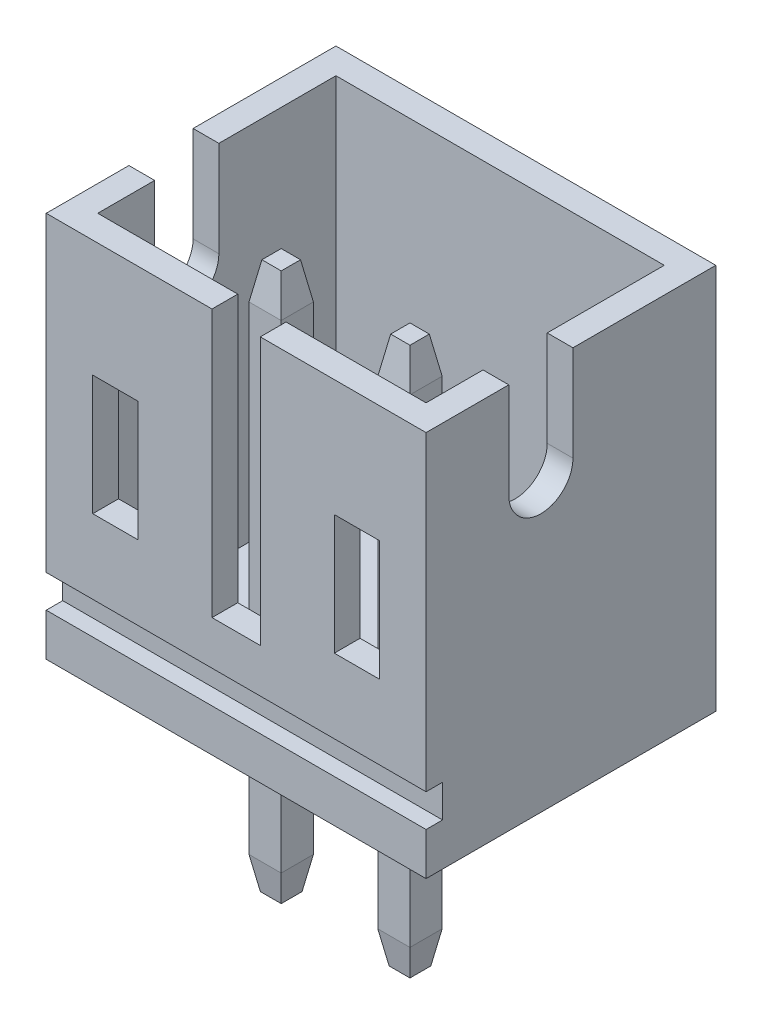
ISO-10303-21;
HEADER;
FILE_DESCRIPTION(('STEP AP214'),'2;1');
FILE_NAME('part.step','',(''),(''),'','','');
FILE_SCHEMA(('AUTOMOTIVE_DESIGN { 1 0 10303 214 1 1 1 1 }'));
ENDSEC;
DATA;
#1=APPLICATION_CONTEXT('core data for automotive mechanical design processes');
#2=APPLICATION_PROTOCOL_DEFINITION('international standard','automotive_design',2000,#1);
#3=PRODUCT_CONTEXT('',#1,'mechanical');
#4=PRODUCT('Part','Part','',(#3));
#5=PRODUCT_RELATED_PRODUCT_CATEGORY('part','',(#4));
#6=PRODUCT_DEFINITION_FORMATION('','',#4);
#7=PRODUCT_DEFINITION_CONTEXT('part definition',#1,'design');
#8=PRODUCT_DEFINITION('design','',#6,#7);
#9=PRODUCT_DEFINITION_SHAPE('','',#8);
#10=(LENGTH_UNIT() NAMED_UNIT(*) SI_UNIT(.MILLI.,.METRE.));
#11=(NAMED_UNIT(*) PLANE_ANGLE_UNIT() SI_UNIT($,.RADIAN.));
#12=(NAMED_UNIT(*) SI_UNIT($,.STERADIAN.) SOLID_ANGLE_UNIT());
#13=UNCERTAINTY_MEASURE_WITH_UNIT(LENGTH_MEASURE(1.E-05),#10,'distance_accuracy_value','');
#14=(GEOMETRIC_REPRESENTATION_CONTEXT(3) GLOBAL_UNCERTAINTY_ASSIGNED_CONTEXT((#13)) GLOBAL_UNIT_ASSIGNED_CONTEXT((#10,
#11,#12)) REPRESENTATION_CONTEXT('',''));
#15=CARTESIAN_POINT('',(0.,0.,0.));
#16=DIRECTION('',(0.,0.,1.));
#17=DIRECTION('',(1.,0.,0.));
#18=AXIS2_PLACEMENT_3D('',#15,#16,#17);
#19=CARTESIAN_POINT('',(-2.95,6.,2.25));
#20=DIRECTION('',(0.,0.,-1.));
#21=DIRECTION('',(-1.,0.,0.));
#22=AXIS2_PLACEMENT_3D('',#19,#20,#21);
#23=PLANE('',#22);
#24=DIRECTION('',(0.,-1.,0.));
#25=VECTOR('',#24,1.);
#26=CARTESIAN_POINT('',(-2.95,6.,2.25));
#27=LINE('',#26,#25);
#28=CARTESIAN_POINT('',(-2.95,6.,2.25));
#29=VERTEX_POINT('',#28);
#30=CARTESIAN_POINT('',(-2.95,1.16828380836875,2.25));
#31=VERTEX_POINT('',#30);
#32=EDGE_CURVE('E674',#29,#31,#27,.T.);
#33=ORIENTED_EDGE('',*,*,#32,.T.);
#34=DIRECTION('',(1.,0.,0.));
#35=VECTOR('',#34,1.);
#36=CARTESIAN_POINT('',(-2.95,1.16828380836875,2.25));
#37=LINE('',#36,#35);
#38=CARTESIAN_POINT('',(2.95,1.16828380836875,2.25));
#39=VERTEX_POINT('',#38);
#40=EDGE_CURVE('E525',#31,#39,#37,.T.);
#41=ORIENTED_EDGE('',*,*,#40,.T.);
#42=DIRECTION('',(0.,-1.,0.));
#43=VECTOR('',#42,1.);
#44=CARTESIAN_POINT('',(2.95,6.,2.25));
#45=LINE('',#44,#43);
#46=CARTESIAN_POINT('',(2.95,6.,2.25));
#47=VERTEX_POINT('',#46);
#48=EDGE_CURVE('E670',#47,#39,#45,.T.);
#49=ORIENTED_EDGE('',*,*,#48,.F.);
#50=DIRECTION('',(1.,0.,0.));
#51=VECTOR('',#50,1.);
#52=CARTESIAN_POINT('',(-2.95,6.,2.25));
#53=LINE('',#52,#51);
#54=CARTESIAN_POINT('',(0.375000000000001,6.,2.25));
#55=VERTEX_POINT('',#54);
#56=EDGE_CURVE('E643',#55,#47,#53,.T.);
#57=ORIENTED_EDGE('',*,*,#56,.F.);
#58=DIRECTION('',(0.,1.,0.));
#59=VECTOR('',#58,1.);
#60=CARTESIAN_POINT('',(0.375000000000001,6.,2.25));
#61=LINE('',#60,#59);
#62=CARTESIAN_POINT('',(0.375000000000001,1.84856815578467,2.25));
#63=VERTEX_POINT('',#62);
#64=EDGE_CURVE('E579',#63,#55,#61,.T.);
#65=ORIENTED_EDGE('',*,*,#64,.F.);
#66=DIRECTION('',(1.,0.,0.));
#67=VECTOR('',#66,1.);
#68=CARTESIAN_POINT('',(-0.374999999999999,1.84856815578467,2.25));
#69=LINE('',#68,#67);
#70=CARTESIAN_POINT('',(-0.374999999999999,1.84856815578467,2.25));
#71=VERTEX_POINT('',#70);
#72=EDGE_CURVE('E582',#71,#63,#69,.T.);
#73=ORIENTED_EDGE('',*,*,#72,.F.);
#74=DIRECTION('',(0.,-1.,0.));
#75=VECTOR('',#74,1.);
#76=CARTESIAN_POINT('',(-0.375,6.,2.25));
#77=LINE('',#76,#75);
#78=CARTESIAN_POINT('',(-0.375,6.,2.25));
#79=VERTEX_POINT('',#78);
#80=EDGE_CURVE('E578',#79,#71,#77,.T.);
#81=ORIENTED_EDGE('',*,*,#80,.F.);
#82=EDGE_CURVE('E645',#29,#79,#53,.T.);
#83=ORIENTED_EDGE('',*,*,#82,.F.);
#84=EDGE_LOOP('',(#33,#41,#49,#57,#65,#73,#81,#83));
#85=FACE_BOUND('',#84,.T.);
#86=DIRECTION('',(1.,0.,0.));
#87=VECTOR('',#86,1.);
#88=CARTESIAN_POINT('',(1.52484271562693,2.32016036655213,2.25));
#89=LINE('',#88,#87);
#90=CARTESIAN_POINT('',(1.52484271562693,2.32016036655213,2.25));
#91=VERTEX_POINT('',#90);
#92=CARTESIAN_POINT('',(2.22724821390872,2.32016036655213,2.25));
#93=VERTEX_POINT('',#92);
#94=EDGE_CURVE('E433',#91,#93,#89,.T.);
#95=ORIENTED_EDGE('',*,*,#94,.F.);
#96=DIRECTION('',(0.,-1.,0.));
#97=VECTOR('',#96,1.);
#98=CARTESIAN_POINT('',(1.52484271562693,2.32016036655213,2.25));
#99=LINE('',#98,#97);
#100=CARTESIAN_POINT('',(1.52484271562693,4.18467798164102,2.25));
#101=VERTEX_POINT('',#100);
#102=EDGE_CURVE('E436',#101,#91,#99,.T.);
#103=ORIENTED_EDGE('',*,*,#102,.F.);
#104=DIRECTION('',(-1.,0.,0.));
#105=VECTOR('',#104,1.);
#106=CARTESIAN_POINT('',(1.52484271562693,4.18467798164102,2.25));
#107=LINE('',#106,#105);
#108=CARTESIAN_POINT('',(2.22724821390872,4.18467798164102,2.25));
#109=VERTEX_POINT('',#108);
#110=EDGE_CURVE('E426',#109,#101,#107,.T.);
#111=ORIENTED_EDGE('',*,*,#110,.F.);
#112=DIRECTION('',(0.,1.,0.));
#113=VECTOR('',#112,1.);
#114=CARTESIAN_POINT('',(2.22724821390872,2.32016036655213,2.25));
#115=LINE('',#114,#113);
#116=EDGE_CURVE('E430',#93,#109,#115,.T.);
#117=ORIENTED_EDGE('',*,*,#116,.F.);
#118=EDGE_LOOP('',(#95,#103,#111,#117));
#119=FACE_BOUND('',#118,.T.);
#120=DIRECTION('',(0.,-1.,0.));
#121=VECTOR('',#120,1.);
#122=CARTESIAN_POINT('',(-1.52484271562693,2.32016036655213,2.25));
#123=LINE('',#122,#121);
#124=CARTESIAN_POINT('',(-1.52484271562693,4.18467798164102,2.25));
#125=VERTEX_POINT('',#124);
#126=CARTESIAN_POINT('',(-1.52484271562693,2.32016036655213,2.25));
#127=VERTEX_POINT('',#126);
#128=EDGE_CURVE('E47',#125,#127,#123,.T.);
#129=ORIENTED_EDGE('',*,*,#128,.T.);
#130=DIRECTION('',(-1.,0.,0.));
#131=VECTOR('',#130,1.);
#132=CARTESIAN_POINT('',(-1.52484271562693,2.32016036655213,2.25));
#133=LINE('',#132,#131);
#134=CARTESIAN_POINT('',(-2.22724821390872,2.32016036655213,2.25));
#135=VERTEX_POINT('',#134);
#136=EDGE_CURVE('E393',#127,#135,#133,.T.);
#137=ORIENTED_EDGE('',*,*,#136,.T.);
#138=DIRECTION('',(0.,1.,0.));
#139=VECTOR('',#138,1.);
#140=CARTESIAN_POINT('',(-2.22724821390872,2.32016036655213,2.25));
#141=LINE('',#140,#139);
#142=CARTESIAN_POINT('',(-2.22724821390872,4.18467798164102,2.25));
#143=VERTEX_POINT('',#142);
#144=EDGE_CURVE('E412',#135,#143,#141,.T.);
#145=ORIENTED_EDGE('',*,*,#144,.T.);
#146=DIRECTION('',(1.,0.,0.));
#147=VECTOR('',#146,1.);
#148=CARTESIAN_POINT('',(-1.52484271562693,4.18467798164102,2.25));
#149=LINE('',#148,#147);
#150=EDGE_CURVE('E406',#143,#125,#149,.T.);
#151=ORIENTED_EDGE('',*,*,#150,.T.);
#152=EDGE_LOOP('',(#129,#137,#145,#151));
#153=FACE_BOUND('',#152,.T.);
#154=ADVANCED_FACE('F32',(#85,#119,#153),#23,.F.);
#155=CARTESIAN_POINT('',(-2.95,6.,1.85));
#156=DIRECTION('',(0.,0.,-1.));
#157=DIRECTION('',(-1.,0.,0.));
#158=AXIS2_PLACEMENT_3D('',#155,#156,#157);
#159=PLANE('',#158);
#160=DIRECTION('',(0.,-1.,0.));
#161=VECTOR('',#160,1.);
#162=CARTESIAN_POINT('',(-0.375,6.,1.85));
#163=LINE('',#162,#161);
#164=CARTESIAN_POINT('',(-0.375,6.,1.85));
#165=VERTEX_POINT('',#164);
#166=CARTESIAN_POINT('',(-0.374999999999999,1.84856815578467,1.85));
#167=VERTEX_POINT('',#166);
#168=EDGE_CURVE('E581',#165,#167,#163,.T.);
#169=ORIENTED_EDGE('',*,*,#168,.T.);
#170=DIRECTION('',(1.,0.,0.));
#171=VECTOR('',#170,1.);
#172=CARTESIAN_POINT('',(-0.374999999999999,1.84856815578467,1.85));
#173=LINE('',#172,#171);
#174=CARTESIAN_POINT('',(0.375000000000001,1.84856815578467,1.85));
#175=VERTEX_POINT('',#174);
#176=EDGE_CURVE('E595',#167,#175,#173,.T.);
#177=ORIENTED_EDGE('',*,*,#176,.T.);
#178=DIRECTION('',(0.,1.,0.));
#179=VECTOR('',#178,1.);
#180=CARTESIAN_POINT('',(0.375000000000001,6.,1.85));
#181=LINE('',#180,#179);
#182=CARTESIAN_POINT('',(0.375,6.,1.85));
#183=VERTEX_POINT('',#182);
#184=EDGE_CURVE('E590',#175,#183,#181,.T.);
#185=ORIENTED_EDGE('',*,*,#184,.T.);
#186=DIRECTION('',(1.,0.,0.));
#187=VECTOR('',#186,1.);
#188=CARTESIAN_POINT('',(-2.95,6.,1.85));
#189=LINE('',#188,#187);
#190=CARTESIAN_POINT('',(2.55,6.,1.85));
#191=VERTEX_POINT('',#190);
#192=EDGE_CURVE('E631',#183,#191,#189,.T.);
#193=ORIENTED_EDGE('',*,*,#192,.T.);
#194=DIRECTION('',(0.,-1.,0.));
#195=VECTOR('',#194,1.);
#196=CARTESIAN_POINT('',(2.55,6.,1.85));
#197=LINE('',#196,#195);
#198=CARTESIAN_POINT('',(2.55,0.4,1.85));
#199=VERTEX_POINT('',#198);
#200=EDGE_CURVE('E612',#191,#199,#197,.T.);
#201=ORIENTED_EDGE('',*,*,#200,.T.);
#202=DIRECTION('',(1.,0.,0.));
#203=VECTOR('',#202,1.);
#204=CARTESIAN_POINT('',(-2.95,0.4,1.85));
#205=LINE('',#204,#203);
#206=CARTESIAN_POINT('',(-2.55,0.4,1.85));
#207=VERTEX_POINT('',#206);
#208=EDGE_CURVE('E607',#207,#199,#205,.T.);
#209=ORIENTED_EDGE('',*,*,#208,.F.);
#210=DIRECTION('',(0.,-1.,0.));
#211=VECTOR('',#210,1.);
#212=CARTESIAN_POINT('',(-2.55,6.,1.85));
#213=LINE('',#212,#211);
#214=CARTESIAN_POINT('',(-2.55,6.,1.85));
#215=VERTEX_POINT('',#214);
#216=EDGE_CURVE('E608',#215,#207,#213,.T.);
#217=ORIENTED_EDGE('',*,*,#216,.F.);
#218=EDGE_CURVE('E632',#215,#165,#189,.T.);
#219=ORIENTED_EDGE('',*,*,#218,.T.);
#220=EDGE_LOOP('',(#169,#177,#185,#193,#201,#209,#217,#219));
#221=FACE_BOUND('',#220,.T.);
#222=DIRECTION('',(0.,-1.,0.));
#223=VECTOR('',#222,1.);
#224=CARTESIAN_POINT('',(1.52484271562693,2.32016036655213,1.85));
#225=LINE('',#224,#223);
#226=CARTESIAN_POINT('',(1.52484271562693,4.18467798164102,1.85));
#227=VERTEX_POINT('',#226);
#228=CARTESIAN_POINT('',(1.52484271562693,2.32016036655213,1.85));
#229=VERTEX_POINT('',#228);
#230=EDGE_CURVE('E399',#227,#229,#225,.T.);
#231=ORIENTED_EDGE('',*,*,#230,.T.);
#232=DIRECTION('',(1.,0.,0.));
#233=VECTOR('',#232,1.);
#234=CARTESIAN_POINT('',(1.52484271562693,2.32016036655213,1.85));
#235=LINE('',#234,#233);
#236=CARTESIAN_POINT('',(2.22724821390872,2.32016036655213,1.85));
#237=VERTEX_POINT('',#236);
#238=EDGE_CURVE('E421',#229,#237,#235,.T.);
#239=ORIENTED_EDGE('',*,*,#238,.T.);
#240=DIRECTION('',(0.,1.,0.));
#241=VECTOR('',#240,1.);
#242=CARTESIAN_POINT('',(2.22724821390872,2.32016036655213,1.85));
#243=LINE('',#242,#241);
#244=CARTESIAN_POINT('',(2.22724821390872,4.18467798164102,1.85));
#245=VERTEX_POINT('',#244);
#246=EDGE_CURVE('E445',#237,#245,#243,.T.);
#247=ORIENTED_EDGE('',*,*,#246,.T.);
#248=DIRECTION('',(-1.,0.,0.));
#249=VECTOR('',#248,1.);
#250=CARTESIAN_POINT('',(1.52484271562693,4.18467798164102,1.85));
#251=LINE('',#250,#249);
#252=EDGE_CURVE('E441',#245,#227,#251,.T.);
#253=ORIENTED_EDGE('',*,*,#252,.T.);
#254=EDGE_LOOP('',(#231,#239,#247,#253));
#255=FACE_BOUND('',#254,.T.);
#256=DIRECTION('',(-1.,0.,0.));
#257=VECTOR('',#256,1.);
#258=CARTESIAN_POINT('',(-1.52484271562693,2.32016036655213,1.85));
#259=LINE('',#258,#257);
#260=CARTESIAN_POINT('',(-1.52484271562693,2.32016036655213,1.85));
#261=VERTEX_POINT('',#260);
#262=CARTESIAN_POINT('',(-2.22724821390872,2.32016036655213,1.85));
#263=VERTEX_POINT('',#262);
#264=EDGE_CURVE('E404',#261,#263,#259,.T.);
#265=ORIENTED_EDGE('',*,*,#264,.F.);
#266=DIRECTION('',(0.,-1.,0.));
#267=VECTOR('',#266,1.);
#268=CARTESIAN_POINT('',(-1.52484271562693,2.32016036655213,1.85));
#269=LINE('',#268,#267);
#270=CARTESIAN_POINT('',(-1.52484271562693,4.18467798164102,1.85));
#271=VERTEX_POINT('',#270);
#272=EDGE_CURVE('E387',#271,#261,#269,.T.);
#273=ORIENTED_EDGE('',*,*,#272,.F.);
#274=DIRECTION('',(1.,0.,0.));
#275=VECTOR('',#274,1.);
#276=CARTESIAN_POINT('',(-1.52484271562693,4.18467798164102,1.85));
#277=LINE('',#276,#275);
#278=CARTESIAN_POINT('',(-2.22724821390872,4.18467798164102,1.85));
#279=VERTEX_POINT('',#278);
#280=EDGE_CURVE('E396',#279,#271,#277,.T.);
#281=ORIENTED_EDGE('',*,*,#280,.F.);
#282=DIRECTION('',(0.,1.,0.));
#283=VECTOR('',#282,1.);
#284=CARTESIAN_POINT('',(-2.22724821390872,2.32016036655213,1.85));
#285=LINE('',#284,#283);
#286=EDGE_CURVE('E55',#263,#279,#285,.T.);
#287=ORIENTED_EDGE('',*,*,#286,.F.);
#288=EDGE_LOOP('',(#265,#273,#281,#287));
#289=FACE_BOUND('',#288,.T.);
#290=ADVANCED_FACE('F402',(#221,#255,#289),#159,.T.);
#291=CARTESIAN_POINT('',(-2.95,6.,2.25));
#292=DIRECTION('',(0.,1.,0.));
#293=DIRECTION('',(0.,0.,1.));
#294=AXIS2_PLACEMENT_3D('',#291,#292,#293);
#295=PLANE('',#294);
#296=DIRECTION('',(0.,0.,1.));
#297=VECTOR('',#296,1.);
#298=CARTESIAN_POINT('',(-2.55,6.,-2.25));
#299=LINE('',#298,#297);
#300=CARTESIAN_POINT('',(-2.55,6.,0.965426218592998));
#301=VERTEX_POINT('',#300);
#302=EDGE_CURVE('E627',#301,#215,#299,.T.);
#303=ORIENTED_EDGE('',*,*,#302,.F.);
#304=DIRECTION('',(-1.,0.,0.));
#305=VECTOR('',#304,1.);
#306=CARTESIAN_POINT('',(2.951,6.,0.965426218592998));
#307=LINE('',#306,#305);
#308=CARTESIAN_POINT('',(-2.95,6.,0.965426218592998));
#309=VERTEX_POINT('',#308);
#310=EDGE_CURVE('E455',#301,#309,#307,.T.);
#311=ORIENTED_EDGE('',*,*,#310,.T.);
#312=DIRECTION('',(0.,0.,1.));
#313=VECTOR('',#312,1.);
#314=CARTESIAN_POINT('',(-2.95,6.,-2.25));
#315=LINE('',#314,#313);
#316=EDGE_CURVE('E644',#309,#29,#315,.T.);
#317=ORIENTED_EDGE('',*,*,#316,.T.);
#318=ORIENTED_EDGE('',*,*,#82,.T.);
#319=DIRECTION('',(0.,0.,1.));
#320=VECTOR('',#319,1.);
#321=CARTESIAN_POINT('',(-0.375,6.,-2.36863560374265));
#322=LINE('',#321,#320);
#323=EDGE_CURVE('E600',#165,#79,#322,.T.);
#324=ORIENTED_EDGE('',*,*,#323,.F.);
#325=ORIENTED_EDGE('',*,*,#218,.F.);
#326=EDGE_LOOP('',(#303,#311,#317,#318,#324,#325));
#327=FACE_BOUND('',#326,.T.);
#328=ADVANCED_FACE('F868',(#327),#295,.T.);
#329=CARTESIAN_POINT('',(-2.95,6.,-2.25));
#330=VERTEX_POINT('',#329);
#331=CARTESIAN_POINT('',(-2.95,6.,-0.0315268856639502));
#332=VERTEX_POINT('',#331);
#333=EDGE_CURVE('E640',#330,#332,#315,.T.);
#334=ORIENTED_EDGE('',*,*,#333,.T.);
#335=DIRECTION('',(-1.,0.,0.));
#336=VECTOR('',#335,1.);
#337=CARTESIAN_POINT('',(2.951,6.,-0.0315268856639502));
#338=LINE('',#337,#336);
#339=CARTESIAN_POINT('',(-2.55,6.,-0.0315268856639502));
#340=VERTEX_POINT('',#339);
#341=EDGE_CURVE('E464',#340,#332,#338,.T.);
#342=ORIENTED_EDGE('',*,*,#341,.F.);
#343=CARTESIAN_POINT('',(-2.55,6.,-1.85));
#344=VERTEX_POINT('',#343);
#345=EDGE_CURVE('E628',#344,#340,#299,.T.);
#346=ORIENTED_EDGE('',*,*,#345,.F.);
#347=DIRECTION('',(-1.,0.,0.));
#348=VECTOR('',#347,1.);
#349=CARTESIAN_POINT('',(-2.95,6.,-1.85));
#350=LINE('',#349,#348);
#351=CARTESIAN_POINT('',(2.55,6.,-1.85));
#352=VERTEX_POINT('',#351);
#353=EDGE_CURVE('E617',#352,#344,#350,.T.);
#354=ORIENTED_EDGE('',*,*,#353,.F.);
#355=DIRECTION('',(0.,0.,-1.));
#356=VECTOR('',#355,1.);
#357=CARTESIAN_POINT('',(2.55,6.,-2.25));
#358=LINE('',#357,#356);
#359=CARTESIAN_POINT('',(2.55,6.,-0.0315268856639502));
#360=VERTEX_POINT('',#359);
#361=EDGE_CURVE('E635',#360,#352,#358,.T.);
#362=ORIENTED_EDGE('',*,*,#361,.F.);
#363=DIRECTION('',(1.,0.,0.));
#364=VECTOR('',#363,1.);
#365=CARTESIAN_POINT('',(-2.951,6.,-0.0315268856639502));
#366=LINE('',#365,#364);
#367=CARTESIAN_POINT('',(2.95,6.,-0.0315268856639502));
#368=VERTEX_POINT('',#367);
#369=EDGE_CURVE('E481',#360,#368,#366,.T.);
#370=ORIENTED_EDGE('',*,*,#369,.T.);
#371=DIRECTION('',(0.,0.,-1.));
#372=VECTOR('',#371,1.);
#373=CARTESIAN_POINT('',(2.95,6.,-2.25));
#374=LINE('',#373,#372);
#375=CARTESIAN_POINT('',(2.95,6.,-2.25));
#376=VERTEX_POINT('',#375);
#377=EDGE_CURVE('E648',#368,#376,#374,.T.);
#378=ORIENTED_EDGE('',*,*,#377,.T.);
#379=DIRECTION('',(-1.,0.,0.));
#380=VECTOR('',#379,1.);
#381=CARTESIAN_POINT('',(-2.95,6.,-2.25));
#382=LINE('',#381,#380);
#383=EDGE_CURVE('E652',#376,#330,#382,.T.);
#384=ORIENTED_EDGE('',*,*,#383,.T.);
#385=EDGE_LOOP('',(#334,#342,#346,#354,#362,#370,#378,#384));
#386=FACE_BOUND('',#385,.T.);
#387=ADVANCED_FACE('F912',(#386),#295,.T.);
#388=CARTESIAN_POINT('',(-2.95,6.,-2.25));
#389=DIRECTION('',(1.,0.,0.));
#390=DIRECTION('',(0.,0.,-1.));
#391=AXIS2_PLACEMENT_3D('',#388,#389,#390);
#392=PLANE('',#391);
#393=DIRECTION('',(0.,-1.,0.));
#394=VECTOR('',#393,1.);
#395=CARTESIAN_POINT('',(-2.95,4.5151607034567,0.965426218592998));
#396=LINE('',#395,#394);
#397=CARTESIAN_POINT('',(-2.95,4.5151607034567,0.965426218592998));
#398=VERTEX_POINT('',#397);
#399=EDGE_CURVE('E463',#309,#398,#396,.T.);
#400=ORIENTED_EDGE('',*,*,#399,.T.);
#401=CARTESIAN_POINT('',(-2.95,4.51516070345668,0.466949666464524));
#402=DIRECTION('',(1.,0.,0.));
#403=DIRECTION('',(0.,0.,-1.));
#404=AXIS2_PLACEMENT_3D('',#401,#402,#403);
#405=CIRCLE('',#404,0.498476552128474);
#406=CARTESIAN_POINT('',(-2.95,4.51516070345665,-0.0315268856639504));
#407=VERTEX_POINT('',#406);
#408=EDGE_CURVE('E459',#398,#407,#405,.T.);
#409=ORIENTED_EDGE('',*,*,#408,.T.);
#410=DIRECTION('',(0.,1.,0.));
#411=VECTOR('',#410,1.);
#412=CARTESIAN_POINT('',(-2.95,4.51516070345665,-0.0315268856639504));
#413=LINE('',#412,#411);
#414=EDGE_CURVE('E460',#407,#332,#413,.T.);
#415=ORIENTED_EDGE('',*,*,#414,.T.);
#416=ORIENTED_EDGE('',*,*,#333,.F.);
#417=DIRECTION('',(0.,-1.,0.));
#418=VECTOR('',#417,1.);
#419=CARTESIAN_POINT('',(-2.95,6.,-2.25));
#420=LINE('',#419,#418);
#421=CARTESIAN_POINT('',(-2.95,0.,-2.25));
#422=VERTEX_POINT('',#421);
#423=EDGE_CURVE('E654',#330,#422,#420,.T.);
#424=ORIENTED_EDGE('',*,*,#423,.T.);
#425=DIRECTION('',(0.,0.,1.));
#426=VECTOR('',#425,1.);
#427=CARTESIAN_POINT('',(-2.95,0.,-2.25));
#428=LINE('',#427,#426);
#429=CARTESIAN_POINT('',(-2.95,0.,2.25));
#430=VERTEX_POINT('',#429);
#431=EDGE_CURVE('E611',#422,#430,#428,.T.);
#432=ORIENTED_EDGE('',*,*,#431,.T.);
#433=CARTESIAN_POINT('',(-2.95,0.661013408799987,2.25));
#434=VERTEX_POINT('',#433);
#435=EDGE_CURVE('E673',#434,#430,#27,.T.);
#436=ORIENTED_EDGE('',*,*,#435,.F.);
#437=DIRECTION('',(0.,0.,-1.));
#438=VECTOR('',#437,1.);
#439=CARTESIAN_POINT('',(-2.95,0.661013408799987,2.71127282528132));
#440=LINE('',#439,#438);
#441=CARTESIAN_POINT('',(-2.95,0.661013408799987,1.99409743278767));
#442=VERTEX_POINT('',#441);
#443=EDGE_CURVE('E504',#434,#442,#440,.T.);
#444=ORIENTED_EDGE('',*,*,#443,.T.);
#445=DIRECTION('',(0.,1.,0.));
#446=VECTOR('',#445,1.);
#447=CARTESIAN_POINT('',(-2.95,1.16828380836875,1.99409743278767));
#448=LINE('',#447,#446);
#449=CARTESIAN_POINT('',(-2.95,1.16828380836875,1.99409743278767));
#450=VERTEX_POINT('',#449);
#451=EDGE_CURVE('E507',#442,#450,#448,.T.);
#452=ORIENTED_EDGE('',*,*,#451,.T.);
#453=DIRECTION('',(0.,0.,1.));
#454=VECTOR('',#453,1.);
#455=CARTESIAN_POINT('',(-2.95,1.16828380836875,2.71127282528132));
#456=LINE('',#455,#454);
#457=EDGE_CURVE('E511',#450,#31,#456,.T.);
#458=ORIENTED_EDGE('',*,*,#457,.T.);
#459=ORIENTED_EDGE('',*,*,#32,.F.);
#460=ORIENTED_EDGE('',*,*,#316,.F.);
#461=EDGE_LOOP('',(#400,#409,#415,#416,#424,#432,#436,#444,#452,#458,#459,#460));
#462=FACE_BOUND('',#461,.T.);
#463=ADVANCED_FACE('F901',(#462),#392,.F.);
#464=CARTESIAN_POINT('',(-2.55,6.,-2.25));
#465=DIRECTION('',(1.,0.,0.));
#466=DIRECTION('',(0.,0.,-1.));
#467=AXIS2_PLACEMENT_3D('',#464,#465,#466);
#468=PLANE('',#467);
#469=CARTESIAN_POINT('',(-2.55,4.51516070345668,0.466949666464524));
#470=DIRECTION('',(1.,0.,0.));
#471=DIRECTION('',(0.,0.,-1.));
#472=AXIS2_PLACEMENT_3D('',#469,#470,#471);
#473=CIRCLE('',#472,0.498476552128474);
#474=CARTESIAN_POINT('',(-2.55,4.5151607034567,0.965426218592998));
#475=VERTEX_POINT('',#474);
#476=CARTESIAN_POINT('',(-2.55,4.51516070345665,-0.0315268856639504));
#477=VERTEX_POINT('',#476);
#478=EDGE_CURVE('E429',#475,#477,#473,.T.);
#479=ORIENTED_EDGE('',*,*,#478,.F.);
#480=DIRECTION('',(0.,-1.,0.));
#481=VECTOR('',#480,1.);
#482=CARTESIAN_POINT('',(-2.55,4.5151607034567,0.965426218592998));
#483=LINE('',#482,#481);
#484=EDGE_CURVE('E453',#301,#475,#483,.T.);
#485=ORIENTED_EDGE('',*,*,#484,.F.);
#486=ORIENTED_EDGE('',*,*,#302,.T.);
#487=ORIENTED_EDGE('',*,*,#216,.T.);
#488=DIRECTION('',(0.,0.,1.));
#489=VECTOR('',#488,1.);
#490=CARTESIAN_POINT('',(-2.55,0.4,-2.25));
#491=LINE('',#490,#489);
#492=CARTESIAN_POINT('',(-2.55,0.4,-1.85));
#493=VERTEX_POINT('',#492);
#494=EDGE_CURVE('E604',#493,#207,#491,.T.);
#495=ORIENTED_EDGE('',*,*,#494,.F.);
#496=DIRECTION('',(0.,-1.,0.));
#497=VECTOR('',#496,1.);
#498=CARTESIAN_POINT('',(-2.55,6.,-1.85));
#499=LINE('',#498,#497);
#500=EDGE_CURVE('E613',#344,#493,#499,.T.);
#501=ORIENTED_EDGE('',*,*,#500,.F.);
#502=ORIENTED_EDGE('',*,*,#345,.T.);
#503=DIRECTION('',(0.,1.,0.));
#504=VECTOR('',#503,1.);
#505=CARTESIAN_POINT('',(-2.55,4.51516070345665,-0.0315268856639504));
#506=LINE('',#505,#504);
#507=EDGE_CURVE('E456',#477,#340,#506,.T.);
#508=ORIENTED_EDGE('',*,*,#507,.F.);
#509=EDGE_LOOP('',(#479,#485,#486,#487,#495,#501,#502,#508));
#510=FACE_BOUND('',#509,.T.);
#511=ADVANCED_FACE('F958',(#510),#468,.T.);
#512=CARTESIAN_POINT('',(-2.95,0.,2.25));
#513=DIRECTION('',(0.,1.,0.));
#514=DIRECTION('',(0.,0.,1.));
#515=AXIS2_PLACEMENT_3D('',#512,#513,#514);
#516=PLANE('',#515);
#517=DIRECTION('',(1.,0.,0.));
#518=VECTOR('',#517,1.);
#519=CARTESIAN_POINT('',(-2.95,0.,0.800000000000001));
#520=LINE('',#519,#518);
#521=CARTESIAN_POINT('',(0.75,0.,0.800000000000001));
#522=VERTEX_POINT('',#521);
#523=CARTESIAN_POINT('',(1.25,0.,0.800000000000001));
#524=VERTEX_POINT('',#523);
#525=EDGE_CURVE('E547',#522,#524,#520,.T.);
#526=ORIENTED_EDGE('',*,*,#525,.T.);
#527=DIRECTION('',(0.,0.,-1.));
#528=VECTOR('',#527,1.);
#529=CARTESIAN_POINT('',(1.25,0.,2.25));
#530=LINE('',#529,#528);
#531=CARTESIAN_POINT('',(1.25,0.,0.300000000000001));
#532=VERTEX_POINT('',#531);
#533=EDGE_CURVE('E550',#524,#532,#530,.T.);
#534=ORIENTED_EDGE('',*,*,#533,.T.);
#535=DIRECTION('',(-1.,0.,0.));
#536=VECTOR('',#535,1.);
#537=CARTESIAN_POINT('',(-2.95,0.,0.300000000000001));
#538=LINE('',#537,#536);
#539=CARTESIAN_POINT('',(0.75,0.,0.300000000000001));
#540=VERTEX_POINT('',#539);
#541=EDGE_CURVE('E541',#532,#540,#538,.T.);
#542=ORIENTED_EDGE('',*,*,#541,.T.);
#543=DIRECTION('',(0.,0.,1.));
#544=VECTOR('',#543,1.);
#545=CARTESIAN_POINT('',(0.75,0.,2.25));
#546=LINE('',#545,#544);
#547=EDGE_CURVE('E544',#540,#522,#546,.T.);
#548=ORIENTED_EDGE('',*,*,#547,.T.);
#549=EDGE_LOOP('',(#526,#534,#542,#548));
#550=FACE_BOUND('',#549,.T.);
#551=ORIENTED_EDGE('',*,*,#431,.F.);
#552=DIRECTION('',(-1.,0.,0.));
#553=VECTOR('',#552,1.);
#554=CARTESIAN_POINT('',(-2.95,0.,-2.25));
#555=LINE('',#554,#553);
#556=CARTESIAN_POINT('',(2.95,0.,-2.25));
#557=VERTEX_POINT('',#556);
#558=EDGE_CURVE('E662',#557,#422,#555,.T.);
#559=ORIENTED_EDGE('',*,*,#558,.F.);
#560=DIRECTION('',(0.,0.,-1.));
#561=VECTOR('',#560,1.);
#562=CARTESIAN_POINT('',(2.95,0.,-2.25));
#563=LINE('',#562,#561);
#564=CARTESIAN_POINT('',(2.95,0.,2.25));
#565=VERTEX_POINT('',#564);
#566=EDGE_CURVE('E660',#565,#557,#563,.T.);
#567=ORIENTED_EDGE('',*,*,#566,.F.);
#568=DIRECTION('',(1.,0.,0.));
#569=VECTOR('',#568,1.);
#570=CARTESIAN_POINT('',(-2.95,0.,2.25));
#571=LINE('',#570,#569);
#572=EDGE_CURVE('E657',#430,#565,#571,.T.);
#573=ORIENTED_EDGE('',*,*,#572,.F.);
#574=EDGE_LOOP('',(#551,#559,#567,#573));
#575=FACE_BOUND('',#574,.T.);
#576=DIRECTION('',(0.,0.,-1.));
#577=VECTOR('',#576,1.);
#578=CARTESIAN_POINT('',(-1.25,0.,2.25));
#579=LINE('',#578,#577);
#580=CARTESIAN_POINT('',(-1.25,0.,0.800000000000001));
#581=VERTEX_POINT('',#580);
#582=CARTESIAN_POINT('',(-1.25,0.,0.300000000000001));
#583=VERTEX_POINT('',#582);
#584=EDGE_CURVE('E575',#581,#583,#579,.T.);
#585=ORIENTED_EDGE('',*,*,#584,.F.);
#586=DIRECTION('',(-1.,0.,0.));
#587=VECTOR('',#586,1.);
#588=CARTESIAN_POINT('',(-2.95,0.,0.800000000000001));
#589=LINE('',#588,#587);
#590=CARTESIAN_POINT('',(-0.75,0.,0.800000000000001));
#591=VERTEX_POINT('',#590);
#592=EDGE_CURVE('E566',#591,#581,#589,.T.);
#593=ORIENTED_EDGE('',*,*,#592,.F.);
#594=DIRECTION('',(0.,0.,1.));
#595=VECTOR('',#594,1.);
#596=CARTESIAN_POINT('',(-0.75,0.,2.25));
#597=LINE('',#596,#595);
#598=CARTESIAN_POINT('',(-0.75,0.,0.300000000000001));
#599=VERTEX_POINT('',#598);
#600=EDGE_CURVE('E569',#599,#591,#597,.T.);
#601=ORIENTED_EDGE('',*,*,#600,.F.);
#602=DIRECTION('',(1.,0.,0.));
#603=VECTOR('',#602,1.);
#604=CARTESIAN_POINT('',(-2.95,0.,0.300000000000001));
#605=LINE('',#604,#603);
#606=EDGE_CURVE('E572',#583,#599,#605,.T.);
#607=ORIENTED_EDGE('',*,*,#606,.F.);
#608=EDGE_LOOP('',(#585,#593,#601,#607));
#609=FACE_BOUND('',#608,.T.);
#610=ADVANCED_FACE('F840',(#550,#575,#609),#516,.F.);
#611=CARTESIAN_POINT('',(-2.95,0.4,2.25));
#612=DIRECTION('',(0.,1.,0.));
#613=DIRECTION('',(0.,0.,1.));
#614=AXIS2_PLACEMENT_3D('',#611,#612,#613);
#615=PLANE('',#614);
#616=DIRECTION('',(0.,0.,-1.));
#617=VECTOR('',#616,1.);
#618=CARTESIAN_POINT('',(1.25,0.4,2.25));
#619=LINE('',#618,#617);
#620=CARTESIAN_POINT('',(1.25,0.4,0.800000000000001));
#621=VERTEX_POINT('',#620);
#622=CARTESIAN_POINT('',(1.25,0.4,0.300000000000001));
#623=VERTEX_POINT('',#622);
#624=EDGE_CURVE('E753',#621,#623,#619,.T.);
#625=ORIENTED_EDGE('',*,*,#624,.F.);
#626=DIRECTION('',(1.,0.,0.));
#627=VECTOR('',#626,1.);
#628=CARTESIAN_POINT('',(-2.95,0.4,0.800000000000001));
#629=LINE('',#628,#627);
#630=CARTESIAN_POINT('',(0.75,0.4,0.800000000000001));
#631=VERTEX_POINT('',#630);
#632=EDGE_CURVE('E750',#631,#621,#629,.T.);
#633=ORIENTED_EDGE('',*,*,#632,.F.);
#634=DIRECTION('',(0.,0.,1.));
#635=VECTOR('',#634,1.);
#636=CARTESIAN_POINT('',(0.75,0.4,2.25));
#637=LINE('',#636,#635);
#638=CARTESIAN_POINT('',(0.75,0.4,0.300000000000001));
#639=VERTEX_POINT('',#638);
#640=EDGE_CURVE('E747',#639,#631,#637,.T.);
#641=ORIENTED_EDGE('',*,*,#640,.F.);
#642=DIRECTION('',(-1.,0.,0.));
#643=VECTOR('',#642,1.);
#644=CARTESIAN_POINT('',(-2.95,0.4,0.300000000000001));
#645=LINE('',#644,#643);
#646=EDGE_CURVE('E736',#623,#639,#645,.T.);
#647=ORIENTED_EDGE('',*,*,#646,.F.);
#648=EDGE_LOOP('',(#625,#633,#641,#647));
#649=FACE_BOUND('',#648,.T.);
#650=ORIENTED_EDGE('',*,*,#494,.T.);
#651=ORIENTED_EDGE('',*,*,#208,.T.);
#652=DIRECTION('',(0.,0.,-1.));
#653=VECTOR('',#652,1.);
#654=CARTESIAN_POINT('',(2.55,0.4,-2.25));
#655=LINE('',#654,#653);
#656=CARTESIAN_POINT('',(2.55,0.4,-1.85));
#657=VERTEX_POINT('',#656);
#658=EDGE_CURVE('E619',#199,#657,#655,.T.);
#659=ORIENTED_EDGE('',*,*,#658,.T.);
#660=DIRECTION('',(-1.,0.,0.));
#661=VECTOR('',#660,1.);
#662=CARTESIAN_POINT('',(-2.95,0.4,-1.85));
#663=LINE('',#662,#661);
#664=EDGE_CURVE('E623',#657,#493,#663,.T.);
#665=ORIENTED_EDGE('',*,*,#664,.T.);
#666=EDGE_LOOP('',(#650,#651,#659,#665));
#667=FACE_BOUND('',#666,.T.);
#668=DIRECTION('',(-1.,0.,0.));
#669=VECTOR('',#668,1.);
#670=CARTESIAN_POINT('',(-2.95,0.4,0.800000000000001));
#671=LINE('',#670,#669);
#672=CARTESIAN_POINT('',(-0.75,0.4,0.800000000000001));
#673=VERTEX_POINT('',#672);
#674=CARTESIAN_POINT('',(-1.25,0.4,0.800000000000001));
#675=VERTEX_POINT('',#674);
#676=EDGE_CURVE('E677',#673,#675,#671,.T.);
#677=ORIENTED_EDGE('',*,*,#676,.T.);
#678=DIRECTION('',(0.,0.,-1.));
#679=VECTOR('',#678,1.);
#680=CARTESIAN_POINT('',(-1.25,0.4,2.25));
#681=LINE('',#680,#679);
#682=CARTESIAN_POINT('',(-1.25,0.4,0.300000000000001));
#683=VERTEX_POINT('',#682);
#684=EDGE_CURVE('E686',#675,#683,#681,.T.);
#685=ORIENTED_EDGE('',*,*,#684,.T.);
#686=DIRECTION('',(1.,0.,0.));
#687=VECTOR('',#686,1.);
#688=CARTESIAN_POINT('',(-2.95,0.4,0.300000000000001));
#689=LINE('',#688,#687);
#690=CARTESIAN_POINT('',(-0.75,0.4,0.300000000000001));
#691=VERTEX_POINT('',#690);
#692=EDGE_CURVE('E683',#683,#691,#689,.T.);
#693=ORIENTED_EDGE('',*,*,#692,.T.);
#694=DIRECTION('',(0.,0.,1.));
#695=VECTOR('',#694,1.);
#696=CARTESIAN_POINT('',(-0.75,0.4,2.25));
#697=LINE('',#696,#695);
#698=EDGE_CURVE('E680',#691,#673,#697,.T.);
#699=ORIENTED_EDGE('',*,*,#698,.T.);
#700=EDGE_LOOP('',(#677,#685,#693,#699));
#701=FACE_BOUND('',#700,.T.);
#702=ADVANCED_FACE('F876',(#649,#667,#701),#615,.T.);
#703=CARTESIAN_POINT('',(2.95,0.661013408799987,2.25));
#704=VERTEX_POINT('',#703);
#705=EDGE_CURVE('E669',#704,#565,#45,.T.);
#706=ORIENTED_EDGE('',*,*,#705,.F.);
#707=DIRECTION('',(-1.,0.,0.));
#708=VECTOR('',#707,1.);
#709=CARTESIAN_POINT('',(-2.95,0.661013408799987,2.25));
#710=LINE('',#709,#708);
#711=EDGE_CURVE('E520',#704,#434,#710,.T.);
#712=ORIENTED_EDGE('',*,*,#711,.T.);
#713=ORIENTED_EDGE('',*,*,#435,.T.);
#714=ORIENTED_EDGE('',*,*,#572,.T.);
#715=EDGE_LOOP('',(#706,#712,#713,#714));
#716=FACE_BOUND('',#715,.T.);
#717=ADVANCED_FACE('F864',(#716),#23,.F.);
#718=CARTESIAN_POINT('',(2.95,6.,-2.25));
#719=DIRECTION('',(-1.,0.,0.));
#720=DIRECTION('',(0.,0.,1.));
#721=AXIS2_PLACEMENT_3D('',#718,#719,#720);
#722=PLANE('',#721);
#723=ORIENTED_EDGE('',*,*,#377,.F.);
#724=DIRECTION('',(0.,1.,0.));
#725=VECTOR('',#724,1.);
#726=CARTESIAN_POINT('',(2.95,4.51516070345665,-0.0315268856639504));
#727=LINE('',#726,#725);
#728=CARTESIAN_POINT('',(2.95,4.51516070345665,-0.0315268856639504));
#729=VERTEX_POINT('',#728);
#730=EDGE_CURVE('E485',#729,#368,#727,.T.);
#731=ORIENTED_EDGE('',*,*,#730,.F.);
#732=CARTESIAN_POINT('',(2.95,4.51516070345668,0.466949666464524));
#733=DIRECTION('',(1.,0.,0.));
#734=DIRECTION('',(0.,0.,-1.));
#735=AXIS2_PLACEMENT_3D('',#732,#733,#734);
#736=CIRCLE('',#735,0.498476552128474);
#737=CARTESIAN_POINT('',(2.95,4.5151607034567,0.965426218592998));
#738=VERTEX_POINT('',#737);
#739=EDGE_CURVE('E474',#738,#729,#736,.T.);
#740=ORIENTED_EDGE('',*,*,#739,.F.);
#741=DIRECTION('',(0.,-1.,0.));
#742=VECTOR('',#741,1.);
#743=CARTESIAN_POINT('',(2.95,4.5151607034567,0.965426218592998));
#744=LINE('',#743,#742);
#745=CARTESIAN_POINT('',(2.95,6.,0.965426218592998));
#746=VERTEX_POINT('',#745);
#747=EDGE_CURVE('E482',#746,#738,#744,.T.);
#748=ORIENTED_EDGE('',*,*,#747,.F.);
#749=EDGE_CURVE('E649',#47,#746,#374,.T.);
#750=ORIENTED_EDGE('',*,*,#749,.F.);
#751=ORIENTED_EDGE('',*,*,#48,.T.);
#752=DIRECTION('',(0.,0.,1.));
#753=VECTOR('',#752,1.);
#754=CARTESIAN_POINT('',(2.95,1.16828380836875,2.71127282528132));
#755=LINE('',#754,#753);
#756=CARTESIAN_POINT('',(2.95,1.16828380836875,1.99409743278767));
#757=VERTEX_POINT('',#756);
#758=EDGE_CURVE('E508',#757,#39,#755,.T.);
#759=ORIENTED_EDGE('',*,*,#758,.F.);
#760=DIRECTION('',(0.,1.,0.));
#761=VECTOR('',#760,1.);
#762=CARTESIAN_POINT('',(2.95,1.16828380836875,1.99409743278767));
#763=LINE('',#762,#761);
#764=CARTESIAN_POINT('',(2.95,0.661013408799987,1.99409743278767));
#765=VERTEX_POINT('',#764);
#766=EDGE_CURVE('E499',#765,#757,#763,.T.);
#767=ORIENTED_EDGE('',*,*,#766,.F.);
#768=DIRECTION('',(0.,0.,1.));
#769=VECTOR('',#768,1.);
#770=CARTESIAN_POINT('',(2.95,0.661013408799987,-2.25));
#771=LINE('',#770,#769);
#772=EDGE_CURVE('E11',#765,#704,#771,.T.);
#773=ORIENTED_EDGE('',*,*,#772,.T.);
#774=ORIENTED_EDGE('',*,*,#705,.T.);
#775=ORIENTED_EDGE('',*,*,#566,.T.);
#776=DIRECTION('',(0.,-1.,0.));
#777=VECTOR('',#776,1.);
#778=CARTESIAN_POINT('',(2.95,6.,-2.25));
#779=LINE('',#778,#777);
#780=EDGE_CURVE('E666',#376,#557,#779,.T.);
#781=ORIENTED_EDGE('',*,*,#780,.F.);
#782=EDGE_LOOP('',(#723,#731,#740,#748,#750,#751,#759,#767,#773,#774,#775,#781));
#783=FACE_BOUND('',#782,.T.);
#784=ADVANCED_FACE('F875',(#783),#722,.F.);
#785=CARTESIAN_POINT('',(-2.95,6.,-2.25));
#786=DIRECTION('',(0.,0.,1.));
#787=DIRECTION('',(1.,0.,0.));
#788=AXIS2_PLACEMENT_3D('',#785,#786,#787);
#789=PLANE('',#788);
#790=ORIENTED_EDGE('',*,*,#558,.T.);
#791=ORIENTED_EDGE('',*,*,#423,.F.);
#792=ORIENTED_EDGE('',*,*,#383,.F.);
#793=ORIENTED_EDGE('',*,*,#780,.T.);
#794=EDGE_LOOP('',(#790,#791,#792,#793));
#795=FACE_BOUND('',#794,.T.);
#796=ADVANCED_FACE('F882',(#795),#789,.F.);
#797=DIRECTION('',(1.,0.,0.));
#798=VECTOR('',#797,1.);
#799=CARTESIAN_POINT('',(-2.951,6.,0.965426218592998));
#800=LINE('',#799,#798);
#801=CARTESIAN_POINT('',(2.55,6.,0.965426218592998));
#802=VERTEX_POINT('',#801);
#803=EDGE_CURVE('E493',#802,#746,#800,.T.);
#804=ORIENTED_EDGE('',*,*,#803,.F.);
#805=EDGE_CURVE('E636',#191,#802,#358,.T.);
#806=ORIENTED_EDGE('',*,*,#805,.F.);
#807=ORIENTED_EDGE('',*,*,#192,.F.);
#808=DIRECTION('',(0.,0.,1.));
#809=VECTOR('',#808,1.);
#810=CARTESIAN_POINT('',(0.375000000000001,6.,-2.36863560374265));
#811=LINE('',#810,#809);
#812=EDGE_CURVE('E593',#183,#55,#811,.T.);
#813=ORIENTED_EDGE('',*,*,#812,.T.);
#814=ORIENTED_EDGE('',*,*,#56,.T.);
#815=ORIENTED_EDGE('',*,*,#749,.T.);
#816=EDGE_LOOP('',(#804,#806,#807,#813,#814,#815));
#817=FACE_BOUND('',#816,.T.);
#818=ADVANCED_FACE('F929',(#817),#295,.T.);
#819=CARTESIAN_POINT('',(2.55,6.,-2.25));
#820=DIRECTION('',(-1.,0.,0.));
#821=DIRECTION('',(0.,0.,1.));
#822=AXIS2_PLACEMENT_3D('',#819,#820,#821);
#823=PLANE('',#822);
#824=DIRECTION('',(0.,1.,0.));
#825=VECTOR('',#824,1.);
#826=CARTESIAN_POINT('',(2.55,4.51516070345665,-0.0315268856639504));
#827=LINE('',#826,#825);
#828=CARTESIAN_POINT('',(2.55,4.51516070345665,-0.0315268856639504));
#829=VERTEX_POINT('',#828);
#830=EDGE_CURVE('E478',#829,#360,#827,.T.);
#831=ORIENTED_EDGE('',*,*,#830,.T.);
#832=ORIENTED_EDGE('',*,*,#361,.T.);
#833=DIRECTION('',(0.,-1.,0.));
#834=VECTOR('',#833,1.);
#835=CARTESIAN_POINT('',(2.55,6.,-1.85));
#836=LINE('',#835,#834);
#837=EDGE_CURVE('E616',#352,#657,#836,.T.);
#838=ORIENTED_EDGE('',*,*,#837,.T.);
#839=ORIENTED_EDGE('',*,*,#658,.F.);
#840=ORIENTED_EDGE('',*,*,#200,.F.);
#841=ORIENTED_EDGE('',*,*,#805,.T.);
#842=DIRECTION('',(0.,-1.,0.));
#843=VECTOR('',#842,1.);
#844=CARTESIAN_POINT('',(2.55,4.5151607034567,0.965426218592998));
#845=LINE('',#844,#843);
#846=CARTESIAN_POINT('',(2.55,4.51516070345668,0.965426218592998));
#847=VERTEX_POINT('',#846);
#848=EDGE_CURVE('E489',#802,#847,#845,.T.);
#849=ORIENTED_EDGE('',*,*,#848,.T.);
#850=CARTESIAN_POINT('',(2.55,4.51516070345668,0.466949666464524));
#851=DIRECTION('',(-1.,0.,0.));
#852=DIRECTION('',(0.,0.,1.));
#853=AXIS2_PLACEMENT_3D('',#850,#851,#852);
#854=CIRCLE('',#853,0.498476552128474);
#855=EDGE_CURVE('E494',#847,#829,#854,.F.);
#856=ORIENTED_EDGE('',*,*,#855,.T.);
#857=EDGE_LOOP('',(#831,#832,#838,#839,#840,#841,#849,#856));
#858=FACE_BOUND('',#857,.T.);
#859=ADVANCED_FACE('F968',(#858),#823,.T.);
#860=CARTESIAN_POINT('',(-2.95,6.,-1.85));
#861=DIRECTION('',(0.,0.,1.));
#862=DIRECTION('',(1.,0.,0.));
#863=AXIS2_PLACEMENT_3D('',#860,#861,#862);
#864=PLANE('',#863);
#865=ORIENTED_EDGE('',*,*,#664,.F.);
#866=ORIENTED_EDGE('',*,*,#837,.F.);
#867=ORIENTED_EDGE('',*,*,#353,.T.);
#868=ORIENTED_EDGE('',*,*,#500,.T.);
#869=EDGE_LOOP('',(#865,#866,#867,#868));
#870=FACE_BOUND('',#869,.T.);
#871=ADVANCED_FACE('F965',(#870),#864,.T.);
#872=CARTESIAN_POINT('',(-0.375,6.,-2.36863560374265));
#873=DIRECTION('',(-1.,0.,0.));
#874=DIRECTION('',(0.,-1.,0.));
#875=AXIS2_PLACEMENT_3D('',#872,#873,#874);
#876=PLANE('',#875);
#877=ORIENTED_EDGE('',*,*,#323,.T.);
#878=ORIENTED_EDGE('',*,*,#80,.T.);
#879=DIRECTION('',(0.,0.,1.));
#880=VECTOR('',#879,1.);
#881=CARTESIAN_POINT('',(-0.374999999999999,1.84856815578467,-2.36863560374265));
#882=LINE('',#881,#880);
#883=EDGE_CURVE('E589',#167,#71,#882,.T.);
#884=ORIENTED_EDGE('',*,*,#883,.F.);
#885=ORIENTED_EDGE('',*,*,#168,.F.);
#886=EDGE_LOOP('',(#877,#878,#884,#885));
#887=FACE_BOUND('',#886,.T.);
#888=ADVANCED_FACE('F978',(#887),#876,.F.);
#889=CARTESIAN_POINT('',(-0.374999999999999,1.84856815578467,-2.36863560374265));
#890=DIRECTION('',(0.,-1.,0.));
#891=DIRECTION('',(0.,0.,-1.));
#892=AXIS2_PLACEMENT_3D('',#889,#890,#891);
#893=PLANE('',#892);
#894=ORIENTED_EDGE('',*,*,#883,.T.);
#895=ORIENTED_EDGE('',*,*,#72,.T.);
#896=DIRECTION('',(0.,0.,1.));
#897=VECTOR('',#896,1.);
#898=CARTESIAN_POINT('',(0.375000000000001,1.84856815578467,-2.36863560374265));
#899=LINE('',#898,#897);
#900=EDGE_CURVE('E594',#175,#63,#899,.T.);
#901=ORIENTED_EDGE('',*,*,#900,.F.);
#902=ORIENTED_EDGE('',*,*,#176,.F.);
#903=EDGE_LOOP('',(#894,#895,#901,#902));
#904=FACE_BOUND('',#903,.T.);
#905=ADVANCED_FACE('F975',(#904),#893,.F.);
#906=CARTESIAN_POINT('',(0.375000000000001,6.,-2.36863560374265));
#907=DIRECTION('',(1.,0.,0.));
#908=DIRECTION('',(0.,0.,-1.));
#909=AXIS2_PLACEMENT_3D('',#906,#907,#908);
#910=PLANE('',#909);
#911=ORIENTED_EDGE('',*,*,#900,.T.);
#912=ORIENTED_EDGE('',*,*,#64,.T.);
#913=ORIENTED_EDGE('',*,*,#812,.F.);
#914=ORIENTED_EDGE('',*,*,#184,.F.);
#915=EDGE_LOOP('',(#911,#912,#913,#914));
#916=FACE_BOUND('',#915,.T.);
#917=ADVANCED_FACE('F973',(#916),#910,.F.);
#918=CARTESIAN_POINT('',(-1.25,5.5,0.300000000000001));
#919=DIRECTION('',(0.,-1.,0.));
#920=DIRECTION('',(0.,0.,-1.));
#921=AXIS2_PLACEMENT_3D('',#918,#919,#920);
#922=PLANE('',#921);
#923=DIRECTION('',(-1.,0.,0.));
#924=VECTOR('',#923,1.);
#925=CARTESIAN_POINT('',(-1.25,5.5,0.400000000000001));
#926=LINE('',#925,#924);
#927=CARTESIAN_POINT('',(-0.85,5.5,0.400000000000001));
#928=VERTEX_POINT('',#927);
#929=CARTESIAN_POINT('',(-1.15,5.5,0.400000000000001));
#930=VERTEX_POINT('',#929);
#931=EDGE_CURVE('E696',#928,#930,#926,.T.);
#932=ORIENTED_EDGE('',*,*,#931,.T.);
#933=DIRECTION('',(0.,0.,1.));
#934=VECTOR('',#933,1.);
#935=CARTESIAN_POINT('',(-1.15,5.5,0.300000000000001));
#936=LINE('',#935,#934);
#937=CARTESIAN_POINT('',(-1.15,5.5,0.700000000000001));
#938=VERTEX_POINT('',#937);
#939=EDGE_CURVE('E698',#930,#938,#936,.T.);
#940=ORIENTED_EDGE('',*,*,#939,.T.);
#941=DIRECTION('',(1.,0.,0.));
#942=VECTOR('',#941,1.);
#943=CARTESIAN_POINT('',(-1.25,5.5,0.700000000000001));
#944=LINE('',#943,#942);
#945=CARTESIAN_POINT('',(-0.85,5.5,0.700000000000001));
#946=VERTEX_POINT('',#945);
#947=EDGE_CURVE('E692',#938,#946,#944,.T.);
#948=ORIENTED_EDGE('',*,*,#947,.T.);
#949=DIRECTION('',(0.,0.,-1.));
#950=VECTOR('',#949,1.);
#951=CARTESIAN_POINT('',(-0.85,5.5,0.300000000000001));
#952=LINE('',#951,#950);
#953=EDGE_CURVE('E694',#946,#928,#952,.T.);
#954=ORIENTED_EDGE('',*,*,#953,.T.);
#955=EDGE_LOOP('',(#932,#940,#948,#954));
#956=FACE_BOUND('',#955,.T.);
#957=ADVANCED_FACE('F1006',(#956),#922,.F.);
#958=CARTESIAN_POINT('',(-1.25,-3.,0.800000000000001));
#959=DIRECTION('',(0.,0.,-1.));
#960=DIRECTION('',(-1.,0.,0.));
#961=AXIS2_PLACEMENT_3D('',#958,#959,#960);
#962=PLANE('',#961);
#963=DIRECTION('',(0.,1.,0.));
#964=VECTOR('',#963,1.);
#965=CARTESIAN_POINT('',(-0.75,-3.,0.800000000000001));
#966=LINE('',#965,#964);
#967=CARTESIAN_POINT('',(-0.75,4.93287181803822,0.800000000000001));
#968=VERTEX_POINT('',#967);
#969=EDGE_CURVE('E556',#673,#968,#966,.T.);
#970=ORIENTED_EDGE('',*,*,#969,.T.);
#971=DIRECTION('',(-1.,0.,0.));
#972=VECTOR('',#971,1.);
#973=CARTESIAN_POINT('',(-1.25,4.93287181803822,0.800000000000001));
#974=LINE('',#973,#972);
#975=CARTESIAN_POINT('',(-1.25,4.93287181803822,0.800000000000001));
#976=VERTEX_POINT('',#975);
#977=EDGE_CURVE('E705',#968,#976,#974,.T.);
#978=ORIENTED_EDGE('',*,*,#977,.T.);
#979=DIRECTION('',(0.,1.,0.));
#980=VECTOR('',#979,1.);
#981=CARTESIAN_POINT('',(-1.25,-3.,0.800000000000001));
#982=LINE('',#981,#980);
#983=EDGE_CURVE('E557',#675,#976,#982,.T.);
#984=ORIENTED_EDGE('',*,*,#983,.F.);
#985=ORIENTED_EDGE('',*,*,#676,.F.);
#986=EDGE_LOOP('',(#970,#978,#984,#985));
#987=FACE_BOUND('',#986,.T.);
#988=ADVANCED_FACE('F986',(#987),#962,.F.);
#989=CARTESIAN_POINT('',(-0.75,-3.,0.800000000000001));
#990=DIRECTION('',(-1.,0.,0.));
#991=DIRECTION('',(0.,0.,1.));
#992=AXIS2_PLACEMENT_3D('',#989,#990,#991);
#993=PLANE('',#992);
#994=DIRECTION('',(0.,1.,0.));
#995=VECTOR('',#994,1.);
#996=CARTESIAN_POINT('',(-0.75,-3.,0.300000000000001));
#997=LINE('',#996,#995);
#998=CARTESIAN_POINT('',(-0.75,4.93287181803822,0.300000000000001));
#999=VERTEX_POINT('',#998);
#1000=EDGE_CURVE('E560',#691,#999,#997,.T.);
#1001=ORIENTED_EDGE('',*,*,#1000,.T.);
#1002=DIRECTION('',(0.,0.,1.));
#1003=VECTOR('',#1002,1.);
#1004=CARTESIAN_POINT('',(-0.75,4.93287181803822,0.800000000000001));
#1005=LINE('',#1004,#1003);
#1006=EDGE_CURVE('E703',#999,#968,#1005,.T.);
#1007=ORIENTED_EDGE('',*,*,#1006,.T.);
#1008=ORIENTED_EDGE('',*,*,#969,.F.);
#1009=ORIENTED_EDGE('',*,*,#698,.F.);
#1010=EDGE_LOOP('',(#1001,#1007,#1008,#1009));
#1011=FACE_BOUND('',#1010,.T.);
#1012=ADVANCED_FACE('F991',(#1011),#993,.F.);
#1013=CARTESIAN_POINT('',(-1.25,-3.,0.300000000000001));
#1014=DIRECTION('',(0.,0.,1.));
#1015=DIRECTION('',(1.,0.,0.));
#1016=AXIS2_PLACEMENT_3D('',#1013,#1014,#1015);
#1017=PLANE('',#1016);
#1018=DIRECTION('',(0.,1.,0.));
#1019=VECTOR('',#1018,1.);
#1020=CARTESIAN_POINT('',(-1.25,-3.,0.300000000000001));
#1021=LINE('',#1020,#1019);
#1022=CARTESIAN_POINT('',(-1.25,4.93287181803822,0.300000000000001));
#1023=VERTEX_POINT('',#1022);
#1024=EDGE_CURVE('E563',#683,#1023,#1021,.T.);
#1025=ORIENTED_EDGE('',*,*,#1024,.T.);
#1026=DIRECTION('',(1.,0.,0.));
#1027=VECTOR('',#1026,1.);
#1028=CARTESIAN_POINT('',(-1.25,4.93287181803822,0.300000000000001));
#1029=LINE('',#1028,#1027);
#1030=EDGE_CURVE('E701',#1023,#999,#1029,.T.);
#1031=ORIENTED_EDGE('',*,*,#1030,.T.);
#1032=ORIENTED_EDGE('',*,*,#1000,.F.);
#1033=ORIENTED_EDGE('',*,*,#692,.F.);
#1034=EDGE_LOOP('',(#1025,#1031,#1032,#1033));
#1035=FACE_BOUND('',#1034,.T.);
#1036=ADVANCED_FACE('F1019',(#1035),#1017,.F.);
#1037=CARTESIAN_POINT('',(-1.25,-3.,0.800000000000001));
#1038=DIRECTION('',(1.,0.,0.));
#1039=DIRECTION('',(0.,0.,-1.));
#1040=AXIS2_PLACEMENT_3D('',#1037,#1038,#1039);
#1041=PLANE('',#1040);
#1042=ORIENTED_EDGE('',*,*,#983,.T.);
#1043=DIRECTION('',(0.,0.,-1.));
#1044=VECTOR('',#1043,1.);
#1045=CARTESIAN_POINT('',(-1.25,4.93287181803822,0.800000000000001));
#1046=LINE('',#1045,#1044);
#1047=EDGE_CURVE('E689',#976,#1023,#1046,.T.);
#1048=ORIENTED_EDGE('',*,*,#1047,.T.);
#1049=ORIENTED_EDGE('',*,*,#1024,.F.);
#1050=ORIENTED_EDGE('',*,*,#684,.F.);
#1051=EDGE_LOOP('',(#1042,#1048,#1049,#1050));
#1052=FACE_BOUND('',#1051,.T.);
#1053=ADVANCED_FACE('F1015',(#1052),#1041,.F.);
#1054=CARTESIAN_POINT('',(-1.25,-2.49999999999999,0.300000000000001));
#1055=VERTEX_POINT('',#1054);
#1056=EDGE_CURVE('E564',#1055,#583,#1021,.T.);
#1057=ORIENTED_EDGE('',*,*,#1056,.F.);
#1058=DIRECTION('',(0.,0.,1.));
#1059=VECTOR('',#1058,1.);
#1060=CARTESIAN_POINT('',(-1.25,-2.49999999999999,0.800000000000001));
#1061=LINE('',#1060,#1059);
#1062=CARTESIAN_POINT('',(-1.25,-2.49999999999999,0.800000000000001));
#1063=VERTEX_POINT('',#1062);
#1064=EDGE_CURVE('E727',#1055,#1063,#1061,.T.);
#1065=ORIENTED_EDGE('',*,*,#1064,.T.);
#1066=EDGE_CURVE('E554',#1063,#581,#982,.T.);
#1067=ORIENTED_EDGE('',*,*,#1066,.T.);
#1068=ORIENTED_EDGE('',*,*,#584,.T.);
#1069=EDGE_LOOP('',(#1057,#1065,#1067,#1068));
#1070=FACE_BOUND('',#1069,.T.);
#1071=ADVANCED_FACE('F1027',(#1070),#1041,.F.);
#1072=CARTESIAN_POINT('',(-0.75,-2.49999999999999,0.300000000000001));
#1073=VERTEX_POINT('',#1072);
#1074=EDGE_CURVE('E561',#1073,#599,#997,.T.);
#1075=ORIENTED_EDGE('',*,*,#1074,.F.);
#1076=DIRECTION('',(-1.,0.,0.));
#1077=VECTOR('',#1076,1.);
#1078=CARTESIAN_POINT('',(-1.25,-2.49999999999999,0.300000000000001));
#1079=LINE('',#1078,#1077);
#1080=EDGE_CURVE('E730',#1073,#1055,#1079,.T.);
#1081=ORIENTED_EDGE('',*,*,#1080,.T.);
#1082=ORIENTED_EDGE('',*,*,#1056,.T.);
#1083=ORIENTED_EDGE('',*,*,#606,.T.);
#1084=EDGE_LOOP('',(#1075,#1081,#1082,#1083));
#1085=FACE_BOUND('',#1084,.T.);
#1086=ADVANCED_FACE('F1022',(#1085),#1017,.F.);
#1087=CARTESIAN_POINT('',(-0.75,-2.49999999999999,0.800000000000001));
#1088=VERTEX_POINT('',#1087);
#1089=EDGE_CURVE('E558',#1088,#591,#966,.T.);
#1090=ORIENTED_EDGE('',*,*,#1089,.F.);
#1091=DIRECTION('',(0.,0.,-1.));
#1092=VECTOR('',#1091,1.);
#1093=CARTESIAN_POINT('',(-0.75,-2.49999999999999,0.300000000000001));
#1094=LINE('',#1093,#1092);
#1095=EDGE_CURVE('E732',#1088,#1073,#1094,.T.);
#1096=ORIENTED_EDGE('',*,*,#1095,.T.);
#1097=ORIENTED_EDGE('',*,*,#1074,.T.);
#1098=ORIENTED_EDGE('',*,*,#600,.T.);
#1099=EDGE_LOOP('',(#1090,#1096,#1097,#1098));
#1100=FACE_BOUND('',#1099,.T.);
#1101=ADVANCED_FACE('F1030',(#1100),#993,.F.);
#1102=ORIENTED_EDGE('',*,*,#1066,.F.);
#1103=DIRECTION('',(1.,0.,0.));
#1104=VECTOR('',#1103,1.);
#1105=CARTESIAN_POINT('',(-0.75,-2.49999999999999,0.800000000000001));
#1106=LINE('',#1105,#1104);
#1107=EDGE_CURVE('E734',#1063,#1088,#1106,.T.);
#1108=ORIENTED_EDGE('',*,*,#1107,.T.);
#1109=ORIENTED_EDGE('',*,*,#1089,.T.);
#1110=ORIENTED_EDGE('',*,*,#592,.T.);
#1111=EDGE_LOOP('',(#1102,#1108,#1109,#1110));
#1112=FACE_BOUND('',#1111,.T.);
#1113=ADVANCED_FACE('F1037',(#1112),#962,.F.);
#1114=CARTESIAN_POINT('',(-1.25,-3.,0.300000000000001));
#1115=DIRECTION('',(0.,-1.,0.));
#1116=DIRECTION('',(0.,0.,-1.));
#1117=AXIS2_PLACEMENT_3D('',#1114,#1115,#1116);
#1118=PLANE('',#1117);
#1119=DIRECTION('',(-1.,0.,0.));
#1120=VECTOR('',#1119,1.);
#1121=CARTESIAN_POINT('',(-1.25,-3.,0.711836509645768));
#1122=LINE('',#1121,#1120);
#1123=CARTESIAN_POINT('',(-0.838163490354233,-3.,0.711836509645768));
#1124=VERTEX_POINT('',#1123);
#1125=CARTESIAN_POINT('',(-1.16183650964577,-3.,0.711836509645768));
#1126=VERTEX_POINT('',#1125);
#1127=EDGE_CURVE('E707',#1124,#1126,#1122,.T.);
#1128=ORIENTED_EDGE('',*,*,#1127,.T.);
#1129=DIRECTION('',(0.,0.,-1.));
#1130=VECTOR('',#1129,1.);
#1131=CARTESIAN_POINT('',(-1.16183650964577,-3.,0.300000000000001));
#1132=LINE('',#1131,#1130);
#1133=CARTESIAN_POINT('',(-1.16183650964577,-3.,0.388163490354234));
#1134=VERTEX_POINT('',#1133);
#1135=EDGE_CURVE('E724',#1126,#1134,#1132,.T.);
#1136=ORIENTED_EDGE('',*,*,#1135,.T.);
#1137=DIRECTION('',(1.,0.,0.));
#1138=VECTOR('',#1137,1.);
#1139=CARTESIAN_POINT('',(-0.75,-3.,0.388163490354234));
#1140=LINE('',#1139,#1138);
#1141=CARTESIAN_POINT('',(-0.838163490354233,-3.,0.388163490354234));
#1142=VERTEX_POINT('',#1141);
#1143=EDGE_CURVE('E722',#1134,#1142,#1140,.T.);
#1144=ORIENTED_EDGE('',*,*,#1143,.T.);
#1145=DIRECTION('',(0.,0.,1.));
#1146=VECTOR('',#1145,1.);
#1147=CARTESIAN_POINT('',(-0.838163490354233,-3.,0.800000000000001));
#1148=LINE('',#1147,#1146);
#1149=EDGE_CURVE('E720',#1142,#1124,#1148,.T.);
#1150=ORIENTED_EDGE('',*,*,#1149,.T.);
#1151=EDGE_LOOP('',(#1128,#1136,#1144,#1150));
#1152=FACE_BOUND('',#1151,.T.);
#1153=ADVANCED_FACE('F1098',(#1152),#1118,.T.);
#1154=CARTESIAN_POINT('',(-0.75,4.93287181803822,0.800000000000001));
#1155=DIRECTION('',(-0.984807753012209,-0.173648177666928,0.));
#1156=DIRECTION('',(0.173648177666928,-0.984807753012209,0.));
#1157=AXIS2_PLACEMENT_3D('',#1154,#1155,#1156);
#1158=PLANE('',#1157);
#1159=DIRECTION('',(-0.171087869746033,0.970287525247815,0.171087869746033));
#1160=VECTOR('',#1159,1.);
#1161=CARTESIAN_POINT('',(-0.764635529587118,5.01587403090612,0.314635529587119));
#1162=LINE('',#1161,#1160);
#1163=EDGE_CURVE('E713',#928,#999,#1162,.F.);
#1164=ORIENTED_EDGE('',*,*,#1163,.F.);
#1165=ORIENTED_EDGE('',*,*,#953,.F.);
#1166=DIRECTION('',(-0.171087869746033,0.970287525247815,-0.171087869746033));
#1167=VECTOR('',#1166,1.);
#1168=CARTESIAN_POINT('',(-0.764635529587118,5.01587403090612,0.785364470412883));
#1169=LINE('',#1168,#1167);
#1170=EDGE_CURVE('E716',#968,#946,#1169,.T.);
#1171=ORIENTED_EDGE('',*,*,#1170,.F.);
#1172=ORIENTED_EDGE('',*,*,#1006,.F.);
#1173=EDGE_LOOP('',(#1164,#1165,#1171,#1172));
#1174=FACE_BOUND('',#1173,.T.);
#1175=ADVANCED_FACE('F996',(#1174),#1158,.F.);
#1176=CARTESIAN_POINT('',(-1.25,4.93287181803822,0.800000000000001));
#1177=DIRECTION('',(0.,-0.173648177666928,-0.984807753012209));
#1178=DIRECTION('',(0.,0.984807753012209,-0.173648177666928));
#1179=AXIS2_PLACEMENT_3D('',#1176,#1177,#1178);
#1180=PLANE('',#1179);
#1181=ORIENTED_EDGE('',*,*,#1170,.T.);
#1182=ORIENTED_EDGE('',*,*,#947,.F.);
#1183=DIRECTION('',(-0.171087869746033,-0.970287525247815,0.171087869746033));
#1184=VECTOR('',#1183,1.);
#1185=CARTESIAN_POINT('',(-1.25,4.93287181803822,0.800000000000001));
#1186=LINE('',#1185,#1184);
#1187=EDGE_CURVE('E710',#976,#938,#1186,.F.);
#1188=ORIENTED_EDGE('',*,*,#1187,.F.);
#1189=ORIENTED_EDGE('',*,*,#977,.F.);
#1190=EDGE_LOOP('',(#1181,#1182,#1188,#1189));
#1191=FACE_BOUND('',#1190,.T.);
#1192=ADVANCED_FACE('F1013',(#1191),#1180,.F.);
#1193=CARTESIAN_POINT('',(-1.25,4.93287181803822,0.300000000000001));
#1194=DIRECTION('',(0.,-0.173648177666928,0.984807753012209));
#1195=DIRECTION('',(0.,-0.984807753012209,-0.173648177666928));
#1196=AXIS2_PLACEMENT_3D('',#1193,#1194,#1195);
#1197=PLANE('',#1196);
#1198=ORIENTED_EDGE('',*,*,#1163,.T.);
#1199=ORIENTED_EDGE('',*,*,#1030,.F.);
#1200=DIRECTION('',(0.171087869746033,0.970287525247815,0.171087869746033));
#1201=VECTOR('',#1200,1.);
#1202=CARTESIAN_POINT('',(-1.25,4.93287181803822,0.300000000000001));
#1203=LINE('',#1202,#1201);
#1204=EDGE_CURVE('E708',#930,#1023,#1203,.F.);
#1205=ORIENTED_EDGE('',*,*,#1204,.F.);
#1206=ORIENTED_EDGE('',*,*,#931,.F.);
#1207=EDGE_LOOP('',(#1198,#1199,#1205,#1206));
#1208=FACE_BOUND('',#1207,.T.);
#1209=ADVANCED_FACE('F1002',(#1208),#1197,.F.);
#1210=CARTESIAN_POINT('',(-1.25,4.93287181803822,0.800000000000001));
#1211=DIRECTION('',(0.984807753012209,-0.173648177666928,0.));
#1212=DIRECTION('',(0.173648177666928,0.984807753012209,0.));
#1213=AXIS2_PLACEMENT_3D('',#1210,#1211,#1212);
#1214=PLANE('',#1213);
#1215=ORIENTED_EDGE('',*,*,#1187,.T.);
#1216=ORIENTED_EDGE('',*,*,#939,.F.);
#1217=ORIENTED_EDGE('',*,*,#1204,.T.);
#1218=ORIENTED_EDGE('',*,*,#1047,.F.);
#1219=EDGE_LOOP('',(#1215,#1216,#1217,#1218));
#1220=FACE_BOUND('',#1219,.T.);
#1221=ADVANCED_FACE('F1008',(#1220),#1214,.F.);
#1222=CARTESIAN_POINT('',(-0.838163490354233,-3.,0.300000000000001));
#1223=DIRECTION('',(0.984807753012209,-0.173648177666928,0.));
#1224=DIRECTION('',(0.173648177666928,0.984807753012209,0.));
#1225=AXIS2_PLACEMENT_3D('',#1222,#1223,#1224);
#1226=PLANE('',#1225);
#1227=DIRECTION('',(0.171087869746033,0.970287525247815,-0.171087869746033));
#1228=VECTOR('',#1227,1.);
#1229=CARTESIAN_POINT('',(-0.835582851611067,-2.98536447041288,0.385582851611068));
#1230=LINE('',#1229,#1228);
#1231=EDGE_CURVE('E740',#1073,#1142,#1230,.F.);
#1232=ORIENTED_EDGE('',*,*,#1231,.F.);
#1233=ORIENTED_EDGE('',*,*,#1095,.F.);
#1234=DIRECTION('',(0.171087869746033,0.970287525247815,0.171087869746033));
#1235=VECTOR('',#1234,1.);
#1236=CARTESIAN_POINT('',(-0.850218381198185,-3.06836668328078,0.699781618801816));
#1237=LINE('',#1236,#1235);
#1238=EDGE_CURVE('E711',#1124,#1088,#1237,.T.);
#1239=ORIENTED_EDGE('',*,*,#1238,.F.);
#1240=ORIENTED_EDGE('',*,*,#1149,.F.);
#1241=EDGE_LOOP('',(#1232,#1233,#1239,#1240));
#1242=FACE_BOUND('',#1241,.T.);
#1243=ADVANCED_FACE('F1049',(#1242),#1226,.T.);
#1244=CARTESIAN_POINT('',(-1.25,-3.,0.711836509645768));
#1245=DIRECTION('',(0.,-0.173648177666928,0.984807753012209));
#1246=DIRECTION('',(0.,-0.984807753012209,-0.173648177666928));
#1247=AXIS2_PLACEMENT_3D('',#1244,#1245,#1246);
#1248=PLANE('',#1247);
#1249=ORIENTED_EDGE('',*,*,#1238,.T.);
#1250=ORIENTED_EDGE('',*,*,#1107,.F.);
#1251=DIRECTION('',(0.171087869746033,-0.970287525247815,-0.171087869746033));
#1252=VECTOR('',#1251,1.);
#1253=CARTESIAN_POINT('',(-1.16441714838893,-2.98536447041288,0.714417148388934));
#1254=LINE('',#1253,#1252);
#1255=EDGE_CURVE('E738',#1126,#1063,#1254,.F.);
#1256=ORIENTED_EDGE('',*,*,#1255,.F.);
#1257=ORIENTED_EDGE('',*,*,#1127,.F.);
#1258=EDGE_LOOP('',(#1249,#1250,#1256,#1257));
#1259=FACE_BOUND('',#1258,.T.);
#1260=ADVANCED_FACE('F1104',(#1259),#1248,.T.);
#1261=CARTESIAN_POINT('',(-1.25,-3.,0.388163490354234));
#1262=DIRECTION('',(0.,-0.173648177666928,-0.984807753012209));
#1263=DIRECTION('',(0.,0.984807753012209,-0.173648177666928));
#1264=AXIS2_PLACEMENT_3D('',#1261,#1262,#1263);
#1265=PLANE('',#1264);
#1266=ORIENTED_EDGE('',*,*,#1231,.T.);
#1267=ORIENTED_EDGE('',*,*,#1143,.F.);
#1268=DIRECTION('',(-0.171087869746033,0.970287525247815,-0.171087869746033));
#1269=VECTOR('',#1268,1.);
#1270=CARTESIAN_POINT('',(-1.16441714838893,-2.98536447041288,0.385582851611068));
#1271=LINE('',#1270,#1269);
#1272=EDGE_CURVE('E553',#1055,#1134,#1271,.F.);
#1273=ORIENTED_EDGE('',*,*,#1272,.F.);
#1274=ORIENTED_EDGE('',*,*,#1080,.F.);
#1275=EDGE_LOOP('',(#1266,#1267,#1273,#1274));
#1276=FACE_BOUND('',#1275,.T.);
#1277=ADVANCED_FACE('F1054',(#1276),#1265,.T.);
#1278=CARTESIAN_POINT('',(-1.16183650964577,-3.,0.300000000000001));
#1279=DIRECTION('',(-0.984807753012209,-0.173648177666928,0.));
#1280=DIRECTION('',(0.173648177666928,-0.984807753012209,0.));
#1281=AXIS2_PLACEMENT_3D('',#1278,#1279,#1280);
#1282=PLANE('',#1281);
#1283=ORIENTED_EDGE('',*,*,#1255,.T.);
#1284=ORIENTED_EDGE('',*,*,#1064,.F.);
#1285=ORIENTED_EDGE('',*,*,#1272,.T.);
#1286=ORIENTED_EDGE('',*,*,#1135,.F.);
#1287=EDGE_LOOP('',(#1283,#1284,#1285,#1286));
#1288=FACE_BOUND('',#1287,.T.);
#1289=ADVANCED_FACE('F1058',(#1288),#1282,.T.);
#1290=CARTESIAN_POINT('',(1.25,5.5,0.300000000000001));
#1291=DIRECTION('',(0.,-1.,0.));
#1292=DIRECTION('',(0.,0.,-1.));
#1293=AXIS2_PLACEMENT_3D('',#1290,#1291,#1292);
#1294=PLANE('',#1293);
#1295=DIRECTION('',(1.,0.,0.));
#1296=VECTOR('',#1295,1.);
#1297=CARTESIAN_POINT('',(1.25,5.5,0.700000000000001));
#1298=LINE('',#1297,#1296);
#1299=CARTESIAN_POINT('',(0.85,5.5,0.700000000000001));
#1300=VERTEX_POINT('',#1299);
#1301=CARTESIAN_POINT('',(1.15,5.5,0.700000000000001));
#1302=VERTEX_POINT('',#1301);
#1303=EDGE_CURVE('E756',#1300,#1302,#1298,.T.);
#1304=ORIENTED_EDGE('',*,*,#1303,.T.);
#1305=DIRECTION('',(0.,0.,-1.));
#1306=VECTOR('',#1305,1.);
#1307=CARTESIAN_POINT('',(1.15,5.5,0.300000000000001));
#1308=LINE('',#1307,#1306);
#1309=CARTESIAN_POINT('',(1.15,5.5,0.400000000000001));
#1310=VERTEX_POINT('',#1309);
#1311=EDGE_CURVE('E762',#1302,#1310,#1308,.T.);
#1312=ORIENTED_EDGE('',*,*,#1311,.T.);
#1313=DIRECTION('',(-1.,0.,0.));
#1314=VECTOR('',#1313,1.);
#1315=CARTESIAN_POINT('',(0.75,5.5,0.400000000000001));
#1316=LINE('',#1315,#1314);
#1317=CARTESIAN_POINT('',(0.85,5.5,0.400000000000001));
#1318=VERTEX_POINT('',#1317);
#1319=EDGE_CURVE('E760',#1310,#1318,#1316,.T.);
#1320=ORIENTED_EDGE('',*,*,#1319,.T.);
#1321=DIRECTION('',(0.,0.,1.));
#1322=VECTOR('',#1321,1.);
#1323=CARTESIAN_POINT('',(0.85,5.5,0.800000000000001));
#1324=LINE('',#1323,#1322);
#1325=EDGE_CURVE('E758',#1318,#1300,#1324,.T.);
#1326=ORIENTED_EDGE('',*,*,#1325,.T.);
#1327=EDGE_LOOP('',(#1304,#1312,#1320,#1326));
#1328=FACE_BOUND('',#1327,.T.);
#1329=ADVANCED_FACE('F1101',(#1328),#1294,.F.);
#1330=CARTESIAN_POINT('',(1.25,-3.,0.300000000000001));
#1331=DIRECTION('',(0.,0.,-1.));
#1332=DIRECTION('',(-1.,0.,0.));
#1333=AXIS2_PLACEMENT_3D('',#1330,#1331,#1332);
#1334=PLANE('',#1333);
#1335=DIRECTION('',(0.,1.,0.));
#1336=VECTOR('',#1335,1.);
#1337=CARTESIAN_POINT('',(0.75,-3.,0.300000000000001));
#1338=LINE('',#1337,#1336);
#1339=CARTESIAN_POINT('',(0.75,4.93287181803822,0.300000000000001));
#1340=VERTEX_POINT('',#1339);
#1341=EDGE_CURVE('E531',#639,#1340,#1338,.T.);
#1342=ORIENTED_EDGE('',*,*,#1341,.T.);
#1343=DIRECTION('',(1.,0.,0.));
#1344=VECTOR('',#1343,1.);
#1345=CARTESIAN_POINT('',(1.25,4.93287181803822,0.300000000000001));
#1346=LINE('',#1345,#1344);
#1347=CARTESIAN_POINT('',(1.25,4.93287181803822,0.300000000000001));
#1348=VERTEX_POINT('',#1347);
#1349=EDGE_CURVE('E768',#1340,#1348,#1346,.T.);
#1350=ORIENTED_EDGE('',*,*,#1349,.T.);
#1351=DIRECTION('',(0.,1.,0.));
#1352=VECTOR('',#1351,1.);
#1353=CARTESIAN_POINT('',(1.25,-3.,0.300000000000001));
#1354=LINE('',#1353,#1352);
#1355=EDGE_CURVE('E532',#623,#1348,#1354,.T.);
#1356=ORIENTED_EDGE('',*,*,#1355,.F.);
#1357=ORIENTED_EDGE('',*,*,#646,.T.);
#1358=EDGE_LOOP('',(#1342,#1350,#1356,#1357));
#1359=FACE_BOUND('',#1358,.T.);
#1360=ADVANCED_FACE('F856',(#1359),#1334,.T.);
#1361=CARTESIAN_POINT('',(0.75,-3.,0.800000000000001));
#1362=DIRECTION('',(-1.,0.,0.));
#1363=DIRECTION('',(0.,0.,1.));
#1364=AXIS2_PLACEMENT_3D('',#1361,#1362,#1363);
#1365=PLANE('',#1364);
#1366=DIRECTION('',(0.,1.,0.));
#1367=VECTOR('',#1366,1.);
#1368=CARTESIAN_POINT('',(0.75,-3.,0.800000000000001));
#1369=LINE('',#1368,#1367);
#1370=CARTESIAN_POINT('',(0.75,4.93287181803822,0.800000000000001));
#1371=VERTEX_POINT('',#1370);
#1372=EDGE_CURVE('E535',#631,#1371,#1369,.T.);
#1373=ORIENTED_EDGE('',*,*,#1372,.T.);
#1374=DIRECTION('',(0.,0.,-1.));
#1375=VECTOR('',#1374,1.);
#1376=CARTESIAN_POINT('',(0.75,4.93287181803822,0.300000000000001));
#1377=LINE('',#1376,#1375);
#1378=EDGE_CURVE('E770',#1371,#1340,#1377,.T.);
#1379=ORIENTED_EDGE('',*,*,#1378,.T.);
#1380=ORIENTED_EDGE('',*,*,#1341,.F.);
#1381=ORIENTED_EDGE('',*,*,#640,.T.);
#1382=EDGE_LOOP('',(#1373,#1379,#1380,#1381));
#1383=FACE_BOUND('',#1382,.T.);
#1384=ADVANCED_FACE('F850',(#1383),#1365,.T.);
#1385=CARTESIAN_POINT('',(1.25,-3.,0.800000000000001));
#1386=DIRECTION('',(0.,0.,1.));
#1387=DIRECTION('',(1.,0.,0.));
#1388=AXIS2_PLACEMENT_3D('',#1385,#1386,#1387);
#1389=PLANE('',#1388);
#1390=DIRECTION('',(0.,1.,0.));
#1391=VECTOR('',#1390,1.);
#1392=CARTESIAN_POINT('',(1.25,-3.,0.800000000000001));
#1393=LINE('',#1392,#1391);
#1394=CARTESIAN_POINT('',(1.25,4.93287181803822,0.800000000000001));
#1395=VERTEX_POINT('',#1394);
#1396=EDGE_CURVE('E538',#621,#1395,#1393,.T.);
#1397=ORIENTED_EDGE('',*,*,#1396,.T.);
#1398=DIRECTION('',(-1.,0.,0.));
#1399=VECTOR('',#1398,1.);
#1400=CARTESIAN_POINT('',(0.75,4.93287181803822,0.800000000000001));
#1401=LINE('',#1400,#1399);
#1402=EDGE_CURVE('E772',#1395,#1371,#1401,.T.);
#1403=ORIENTED_EDGE('',*,*,#1402,.T.);
#1404=ORIENTED_EDGE('',*,*,#1372,.F.);
#1405=ORIENTED_EDGE('',*,*,#632,.T.);
#1406=EDGE_LOOP('',(#1397,#1403,#1404,#1405));
#1407=FACE_BOUND('',#1406,.T.);
#1408=ADVANCED_FACE('F858',(#1407),#1389,.T.);
#1409=CARTESIAN_POINT('',(1.25,-3.,0.800000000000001));
#1410=DIRECTION('',(1.,0.,0.));
#1411=DIRECTION('',(0.,0.,-1.));
#1412=AXIS2_PLACEMENT_3D('',#1409,#1410,#1411);
#1413=PLANE('',#1412);
#1414=ORIENTED_EDGE('',*,*,#1355,.T.);
#1415=DIRECTION('',(0.,0.,1.));
#1416=VECTOR('',#1415,1.);
#1417=CARTESIAN_POINT('',(1.25,4.93287181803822,0.800000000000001));
#1418=LINE('',#1417,#1416);
#1419=EDGE_CURVE('E765',#1348,#1395,#1418,.T.);
#1420=ORIENTED_EDGE('',*,*,#1419,.T.);
#1421=ORIENTED_EDGE('',*,*,#1396,.F.);
#1422=ORIENTED_EDGE('',*,*,#624,.T.);
#1423=EDGE_LOOP('',(#1414,#1420,#1421,#1422));
#1424=FACE_BOUND('',#1423,.T.);
#1425=ADVANCED_FACE('F1199',(#1424),#1413,.T.);
#1426=CARTESIAN_POINT('',(1.25,-2.49999999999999,0.800000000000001));
#1427=VERTEX_POINT('',#1426);
#1428=EDGE_CURVE('E539',#1427,#524,#1393,.T.);
#1429=ORIENTED_EDGE('',*,*,#1428,.F.);
#1430=DIRECTION('',(0.,0.,-1.));
#1431=VECTOR('',#1430,1.);
#1432=CARTESIAN_POINT('',(1.25,-2.49999999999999,0.800000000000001));
#1433=LINE('',#1432,#1431);
#1434=CARTESIAN_POINT('',(1.25,-2.49999999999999,0.300000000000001));
#1435=VERTEX_POINT('',#1434);
#1436=EDGE_CURVE('E774',#1427,#1435,#1433,.T.);
#1437=ORIENTED_EDGE('',*,*,#1436,.T.);
#1438=EDGE_CURVE('E529',#1435,#532,#1354,.T.);
#1439=ORIENTED_EDGE('',*,*,#1438,.T.);
#1440=ORIENTED_EDGE('',*,*,#533,.F.);
#1441=EDGE_LOOP('',(#1429,#1437,#1439,#1440));
#1442=FACE_BOUND('',#1441,.T.);
#1443=ADVANCED_FACE('F834',(#1442),#1413,.T.);
#1444=CARTESIAN_POINT('',(0.75,-2.49999999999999,0.800000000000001));
#1445=VERTEX_POINT('',#1444);
#1446=EDGE_CURVE('E536',#1445,#522,#1369,.T.);
#1447=ORIENTED_EDGE('',*,*,#1446,.F.);
#1448=DIRECTION('',(1.,0.,0.));
#1449=VECTOR('',#1448,1.);
#1450=CARTESIAN_POINT('',(1.25,-2.49999999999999,0.800000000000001));
#1451=LINE('',#1450,#1449);
#1452=EDGE_CURVE('E40',#1445,#1427,#1451,.T.);
#1453=ORIENTED_EDGE('',*,*,#1452,.T.);
#1454=ORIENTED_EDGE('',*,*,#1428,.T.);
#1455=ORIENTED_EDGE('',*,*,#525,.F.);
#1456=EDGE_LOOP('',(#1447,#1453,#1454,#1455));
#1457=FACE_BOUND('',#1456,.T.);
#1458=ADVANCED_FACE('F845',(#1457),#1389,.T.);
#1459=CARTESIAN_POINT('',(0.75,-2.49999999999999,0.300000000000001));
#1460=VERTEX_POINT('',#1459);
#1461=EDGE_CURVE('E533',#1460,#540,#1338,.T.);
#1462=ORIENTED_EDGE('',*,*,#1461,.F.);
#1463=DIRECTION('',(0.,0.,1.));
#1464=VECTOR('',#1463,1.);
#1465=CARTESIAN_POINT('',(0.75,-2.49999999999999,0.800000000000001));
#1466=LINE('',#1465,#1464);
#1467=EDGE_CURVE('E799',#1460,#1445,#1466,.T.);
#1468=ORIENTED_EDGE('',*,*,#1467,.T.);
#1469=ORIENTED_EDGE('',*,*,#1446,.T.);
#1470=ORIENTED_EDGE('',*,*,#547,.F.);
#1471=EDGE_LOOP('',(#1462,#1468,#1469,#1470));
#1472=FACE_BOUND('',#1471,.T.);
#1473=ADVANCED_FACE('F847',(#1472),#1365,.T.);
#1474=ORIENTED_EDGE('',*,*,#1438,.F.);
#1475=DIRECTION('',(-1.,0.,0.));
#1476=VECTOR('',#1475,1.);
#1477=CARTESIAN_POINT('',(1.25,-2.49999999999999,0.300000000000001));
#1478=LINE('',#1477,#1476);
#1479=EDGE_CURVE('E797',#1435,#1460,#1478,.T.);
#1480=ORIENTED_EDGE('',*,*,#1479,.T.);
#1481=ORIENTED_EDGE('',*,*,#1461,.T.);
#1482=ORIENTED_EDGE('',*,*,#541,.F.);
#1483=EDGE_LOOP('',(#1474,#1480,#1481,#1482));
#1484=FACE_BOUND('',#1483,.T.);
#1485=ADVANCED_FACE('F837',(#1484),#1334,.T.);
#1486=CARTESIAN_POINT('',(1.25,-3.,0.300000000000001));
#1487=DIRECTION('',(0.,-1.,0.));
#1488=DIRECTION('',(0.,0.,-1.));
#1489=AXIS2_PLACEMENT_3D('',#1486,#1487,#1488);
#1490=PLANE('',#1489);
#1491=DIRECTION('',(1.,0.,0.));
#1492=VECTOR('',#1491,1.);
#1493=CARTESIAN_POINT('',(1.25,-3.,0.388163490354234));
#1494=LINE('',#1493,#1492);
#1495=CARTESIAN_POINT('',(0.838163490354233,-3.,0.388163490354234));
#1496=VERTEX_POINT('',#1495);
#1497=CARTESIAN_POINT('',(1.16183650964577,-3.,0.388163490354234));
#1498=VERTEX_POINT('',#1497);
#1499=EDGE_CURVE('E792',#1496,#1498,#1494,.T.);
#1500=ORIENTED_EDGE('',*,*,#1499,.T.);
#1501=DIRECTION('',(0.,0.,1.));
#1502=VECTOR('',#1501,1.);
#1503=CARTESIAN_POINT('',(1.16183650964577,-3.,0.300000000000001));
#1504=LINE('',#1503,#1502);
#1505=CARTESIAN_POINT('',(1.16183650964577,-3.,0.711836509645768));
#1506=VERTEX_POINT('',#1505);
#1507=EDGE_CURVE('E794',#1498,#1506,#1504,.T.);
#1508=ORIENTED_EDGE('',*,*,#1507,.T.);
#1509=DIRECTION('',(-1.,0.,0.));
#1510=VECTOR('',#1509,1.);
#1511=CARTESIAN_POINT('',(1.25,-3.,0.711836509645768));
#1512=LINE('',#1511,#1510);
#1513=CARTESIAN_POINT('',(0.838163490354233,-3.,0.711836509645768));
#1514=VERTEX_POINT('',#1513);
#1515=EDGE_CURVE('E788',#1506,#1514,#1512,.T.);
#1516=ORIENTED_EDGE('',*,*,#1515,.T.);
#1517=DIRECTION('',(0.,0.,-1.));
#1518=VECTOR('',#1517,1.);
#1519=CARTESIAN_POINT('',(0.838163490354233,-3.,0.300000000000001));
#1520=LINE('',#1519,#1518);
#1521=EDGE_CURVE('E790',#1514,#1496,#1520,.T.);
#1522=ORIENTED_EDGE('',*,*,#1521,.T.);
#1523=EDGE_LOOP('',(#1500,#1508,#1516,#1522));
#1524=FACE_BOUND('',#1523,.T.);
#1525=ADVANCED_FACE('F820',(#1524),#1490,.T.);
#1526=CARTESIAN_POINT('',(0.85,5.5,0.300000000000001));
#1527=DIRECTION('',(-0.984807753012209,0.173648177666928,0.));
#1528=DIRECTION('',(-0.173648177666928,-0.984807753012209,0.));
#1529=AXIS2_PLACEMENT_3D('',#1526,#1527,#1528);
#1530=PLANE('',#1529);
#1531=DIRECTION('',(-0.171087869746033,-0.970287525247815,-0.171087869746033));
#1532=VECTOR('',#1531,1.);
#1533=CARTESIAN_POINT('',(0.847072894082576,5.48339955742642,0.397072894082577));
#1534=LINE('',#1533,#1532);
#1535=EDGE_CURVE('E780',#1340,#1318,#1534,.F.);
#1536=ORIENTED_EDGE('',*,*,#1535,.F.);
#1537=ORIENTED_EDGE('',*,*,#1378,.F.);
#1538=DIRECTION('',(-0.171087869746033,-0.970287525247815,0.171087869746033));
#1539=VECTOR('',#1538,1.);
#1540=CARTESIAN_POINT('',(0.861708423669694,5.56640177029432,0.688291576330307));
#1541=LINE('',#1540,#1539);
#1542=EDGE_CURVE('E783',#1300,#1371,#1541,.T.);
#1543=ORIENTED_EDGE('',*,*,#1542,.F.);
#1544=ORIENTED_EDGE('',*,*,#1325,.F.);
#1545=EDGE_LOOP('',(#1536,#1537,#1543,#1544));
#1546=FACE_BOUND('',#1545,.T.);
#1547=ADVANCED_FACE('F1121',(#1546),#1530,.T.);
#1548=CARTESIAN_POINT('',(1.25,5.5,0.700000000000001));
#1549=DIRECTION('',(0.,0.173648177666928,0.984807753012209));
#1550=DIRECTION('',(0.,-0.984807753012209,0.173648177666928));
#1551=AXIS2_PLACEMENT_3D('',#1548,#1549,#1550);
#1552=PLANE('',#1551);
#1553=ORIENTED_EDGE('',*,*,#1542,.T.);
#1554=ORIENTED_EDGE('',*,*,#1402,.F.);
#1555=DIRECTION('',(-0.171087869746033,0.970287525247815,-0.171087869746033));
#1556=VECTOR('',#1555,1.);
#1557=CARTESIAN_POINT('',(1.15292710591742,5.48339955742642,0.702927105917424));
#1558=LINE('',#1557,#1556);
#1559=EDGE_CURVE('E777',#1302,#1395,#1558,.F.);
#1560=ORIENTED_EDGE('',*,*,#1559,.F.);
#1561=ORIENTED_EDGE('',*,*,#1303,.F.);
#1562=EDGE_LOOP('',(#1553,#1554,#1560,#1561));
#1563=FACE_BOUND('',#1562,.T.);
#1564=ADVANCED_FACE('F1117',(#1563),#1552,.T.);
#1565=CARTESIAN_POINT('',(1.25,5.5,0.400000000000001));
#1566=DIRECTION('',(0.,0.173648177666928,-0.984807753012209));
#1567=DIRECTION('',(0.,0.984807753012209,0.173648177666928));
#1568=AXIS2_PLACEMENT_3D('',#1565,#1566,#1567);
#1569=PLANE('',#1568);
#1570=ORIENTED_EDGE('',*,*,#1535,.T.);
#1571=ORIENTED_EDGE('',*,*,#1319,.F.);
#1572=DIRECTION('',(0.171087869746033,-0.970287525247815,-0.171087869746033));
#1573=VECTOR('',#1572,1.);
#1574=CARTESIAN_POINT('',(1.15292710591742,5.48339955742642,0.397072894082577));
#1575=LINE('',#1574,#1573);
#1576=EDGE_CURVE('E775',#1348,#1310,#1575,.F.);
#1577=ORIENTED_EDGE('',*,*,#1576,.F.);
#1578=ORIENTED_EDGE('',*,*,#1349,.F.);
#1579=EDGE_LOOP('',(#1570,#1571,#1577,#1578));
#1580=FACE_BOUND('',#1579,.T.);
#1581=ADVANCED_FACE('F1113',(#1580),#1569,.T.);
#1582=CARTESIAN_POINT('',(1.15,5.5,0.300000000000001));
#1583=DIRECTION('',(0.984807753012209,0.173648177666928,0.));
#1584=DIRECTION('',(-0.173648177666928,0.984807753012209,0.));
#1585=AXIS2_PLACEMENT_3D('',#1582,#1583,#1584);
#1586=PLANE('',#1585);
#1587=ORIENTED_EDGE('',*,*,#1559,.T.);
#1588=ORIENTED_EDGE('',*,*,#1419,.F.);
#1589=ORIENTED_EDGE('',*,*,#1576,.T.);
#1590=ORIENTED_EDGE('',*,*,#1311,.F.);
#1591=EDGE_LOOP('',(#1587,#1588,#1589,#1590));
#1592=FACE_BOUND('',#1591,.T.);
#1593=ADVANCED_FACE('F1110',(#1592),#1586,.T.);
#1594=CARTESIAN_POINT('',(0.75,-2.49999999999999,0.800000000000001));
#1595=DIRECTION('',(0.984807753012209,0.173648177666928,0.));
#1596=DIRECTION('',(-0.173648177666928,0.984807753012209,0.));
#1597=AXIS2_PLACEMENT_3D('',#1594,#1595,#1596);
#1598=PLANE('',#1597);
#1599=DIRECTION('',(0.171087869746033,-0.970287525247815,0.171087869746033));
#1600=VECTOR('',#1599,1.);
#1601=CARTESIAN_POINT('',(0.764635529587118,-2.58300221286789,0.314635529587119));
#1602=LINE('',#1601,#1600);
#1603=EDGE_CURVE('E805',#1496,#1460,#1602,.F.);
#1604=ORIENTED_EDGE('',*,*,#1603,.F.);
#1605=ORIENTED_EDGE('',*,*,#1521,.F.);
#1606=DIRECTION('',(0.171087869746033,-0.970287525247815,-0.171087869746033));
#1607=VECTOR('',#1606,1.);
#1608=CARTESIAN_POINT('',(0.764635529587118,-2.58300221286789,0.785364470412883));
#1609=LINE('',#1608,#1607);
#1610=EDGE_CURVE('E778',#1445,#1514,#1609,.T.);
#1611=ORIENTED_EDGE('',*,*,#1610,.F.);
#1612=ORIENTED_EDGE('',*,*,#1467,.F.);
#1613=EDGE_LOOP('',(#1604,#1605,#1611,#1612));
#1614=FACE_BOUND('',#1613,.T.);
#1615=ADVANCED_FACE('F34',(#1614),#1598,.F.);
#1616=CARTESIAN_POINT('',(1.25,-2.49999999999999,0.800000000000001));
#1617=DIRECTION('',(0.,0.173648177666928,-0.984807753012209));
#1618=DIRECTION('',(0.,0.984807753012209,0.173648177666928));
#1619=AXIS2_PLACEMENT_3D('',#1616,#1617,#1618);
#1620=PLANE('',#1619);
#1621=ORIENTED_EDGE('',*,*,#1610,.T.);
#1622=ORIENTED_EDGE('',*,*,#1515,.F.);
#1623=DIRECTION('',(0.171087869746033,0.970287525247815,0.171087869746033));
#1624=VECTOR('',#1623,1.);
#1625=CARTESIAN_POINT('',(1.25,-2.49999999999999,0.800000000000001));
#1626=LINE('',#1625,#1624);
#1627=EDGE_CURVE('E803',#1427,#1506,#1626,.F.);
#1628=ORIENTED_EDGE('',*,*,#1627,.F.);
#1629=ORIENTED_EDGE('',*,*,#1452,.F.);
#1630=EDGE_LOOP('',(#1621,#1622,#1628,#1629));
#1631=FACE_BOUND('',#1630,.T.);
#1632=ADVANCED_FACE('F812',(#1631),#1620,.F.);
#1633=CARTESIAN_POINT('',(1.25,-2.49999999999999,0.300000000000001));
#1634=DIRECTION('',(0.,0.173648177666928,0.984807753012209));
#1635=DIRECTION('',(0.,-0.984807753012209,0.173648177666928));
#1636=AXIS2_PLACEMENT_3D('',#1633,#1634,#1635);
#1637=PLANE('',#1636);
#1638=ORIENTED_EDGE('',*,*,#1603,.T.);
#1639=ORIENTED_EDGE('',*,*,#1479,.F.);
#1640=DIRECTION('',(-0.171087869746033,-0.970287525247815,0.171087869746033));
#1641=VECTOR('',#1640,1.);
#1642=CARTESIAN_POINT('',(1.25,-2.49999999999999,0.300000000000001));
#1643=LINE('',#1642,#1641);
#1644=EDGE_CURVE('E528',#1498,#1435,#1643,.F.);
#1645=ORIENTED_EDGE('',*,*,#1644,.F.);
#1646=ORIENTED_EDGE('',*,*,#1499,.F.);
#1647=EDGE_LOOP('',(#1638,#1639,#1645,#1646));
#1648=FACE_BOUND('',#1647,.T.);
#1649=ADVANCED_FACE('F828',(#1648),#1637,.F.);
#1650=CARTESIAN_POINT('',(1.25,-2.49999999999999,0.800000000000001));
#1651=DIRECTION('',(-0.984807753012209,0.173648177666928,0.));
#1652=DIRECTION('',(-0.173648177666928,-0.984807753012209,0.));
#1653=AXIS2_PLACEMENT_3D('',#1650,#1651,#1652);
#1654=PLANE('',#1653);
#1655=ORIENTED_EDGE('',*,*,#1627,.T.);
#1656=ORIENTED_EDGE('',*,*,#1507,.F.);
#1657=ORIENTED_EDGE('',*,*,#1644,.T.);
#1658=ORIENTED_EDGE('',*,*,#1436,.F.);
#1659=EDGE_LOOP('',(#1655,#1656,#1657,#1658));
#1660=FACE_BOUND('',#1659,.T.);
#1661=ADVANCED_FACE('F824',(#1660),#1654,.F.);
#1662=CARTESIAN_POINT('',(-2.95,1.16828380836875,2.71127282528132));
#1663=DIRECTION('',(0.,1.,0.));
#1664=DIRECTION('',(0.,0.,1.));
#1665=AXIS2_PLACEMENT_3D('',#1662,#1663,#1664);
#1666=PLANE('',#1665);
#1667=ORIENTED_EDGE('',*,*,#457,.F.);
#1668=DIRECTION('',(1.,0.,0.));
#1669=VECTOR('',#1668,1.);
#1670=CARTESIAN_POINT('',(-2.95,1.16828380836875,1.99409743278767));
#1671=LINE('',#1670,#1669);
#1672=EDGE_CURVE('E518',#450,#757,#1671,.T.);
#1673=ORIENTED_EDGE('',*,*,#1672,.T.);
#1674=ORIENTED_EDGE('',*,*,#758,.T.);
#1675=ORIENTED_EDGE('',*,*,#40,.F.);
#1676=EDGE_LOOP('',(#1667,#1673,#1674,#1675));
#1677=FACE_BOUND('',#1676,.T.);
#1678=ADVANCED_FACE('F936',(#1677),#1666,.F.);
#1679=CARTESIAN_POINT('',(-2.95,0.661013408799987,2.71127282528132));
#1680=DIRECTION('',(0.,-1.,0.));
#1681=DIRECTION('',(0.,0.,-1.));
#1682=AXIS2_PLACEMENT_3D('',#1679,#1680,#1681);
#1683=PLANE('',#1682);
#1684=ORIENTED_EDGE('',*,*,#772,.F.);
#1685=DIRECTION('',(1.,0.,0.));
#1686=VECTOR('',#1685,1.);
#1687=CARTESIAN_POINT('',(-2.95,0.661013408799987,1.99409743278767));
#1688=LINE('',#1687,#1686);
#1689=EDGE_CURVE('E514',#442,#765,#1688,.T.);
#1690=ORIENTED_EDGE('',*,*,#1689,.F.);
#1691=ORIENTED_EDGE('',*,*,#443,.F.);
#1692=ORIENTED_EDGE('',*,*,#711,.F.);
#1693=EDGE_LOOP('',(#1684,#1690,#1691,#1692));
#1694=FACE_BOUND('',#1693,.T.);
#1695=ADVANCED_FACE('F895',(#1694),#1683,.F.);
#1696=CARTESIAN_POINT('',(-2.95,1.16828380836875,1.99409743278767));
#1697=DIRECTION('',(0.,0.,-1.));
#1698=DIRECTION('',(-1.,0.,0.));
#1699=AXIS2_PLACEMENT_3D('',#1696,#1697,#1698);
#1700=PLANE('',#1699);
#1701=ORIENTED_EDGE('',*,*,#766,.T.);
#1702=ORIENTED_EDGE('',*,*,#1672,.F.);
#1703=ORIENTED_EDGE('',*,*,#451,.F.);
#1704=ORIENTED_EDGE('',*,*,#1689,.T.);
#1705=EDGE_LOOP('',(#1701,#1702,#1703,#1704));
#1706=FACE_BOUND('',#1705,.T.);
#1707=ADVANCED_FACE('F898',(#1706),#1700,.F.);
#1708=CARTESIAN_POINT('',(-2.951,4.51516070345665,-0.0315268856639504));
#1709=DIRECTION('',(0.,0.,-1.));
#1710=DIRECTION('',(0.,1.,0.));
#1711=AXIS2_PLACEMENT_3D('',#1708,#1709,#1710);
#1712=PLANE('',#1711);
#1713=DIRECTION('',(1.,0.,0.));
#1714=VECTOR('',#1713,1.);
#1715=CARTESIAN_POINT('',(-2.951,4.51516070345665,-0.0315268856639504));
#1716=LINE('',#1715,#1714);
#1717=EDGE_CURVE('E497',#829,#729,#1716,.T.);
#1718=ORIENTED_EDGE('',*,*,#1717,.T.);
#1719=ORIENTED_EDGE('',*,*,#730,.T.);
#1720=ORIENTED_EDGE('',*,*,#369,.F.);
#1721=ORIENTED_EDGE('',*,*,#830,.F.);
#1722=EDGE_LOOP('',(#1718,#1719,#1720,#1721));
#1723=FACE_BOUND('',#1722,.T.);
#1724=ADVANCED_FACE('F919',(#1723),#1712,.F.);
#1725=CARTESIAN_POINT('',(-2.951,4.5151607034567,0.965426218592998));
#1726=DIRECTION('',(0.,0.,1.));
#1727=DIRECTION('',(1.,0.,0.));
#1728=AXIS2_PLACEMENT_3D('',#1725,#1726,#1727);
#1729=PLANE('',#1728);
#1730=ORIENTED_EDGE('',*,*,#803,.T.);
#1731=ORIENTED_EDGE('',*,*,#747,.T.);
#1732=DIRECTION('',(1.,0.,0.));
#1733=VECTOR('',#1732,1.);
#1734=CARTESIAN_POINT('',(-2.951,4.5151607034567,0.965426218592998));
#1735=LINE('',#1734,#1733);
#1736=EDGE_CURVE('E492',#847,#738,#1735,.T.);
#1737=ORIENTED_EDGE('',*,*,#1736,.F.);
#1738=ORIENTED_EDGE('',*,*,#848,.F.);
#1739=EDGE_LOOP('',(#1730,#1731,#1737,#1738));
#1740=FACE_BOUND('',#1739,.T.);
#1741=ADVANCED_FACE('F925',(#1740),#1729,.F.);
#1742=CARTESIAN_POINT('',(-2.951,4.51516070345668,0.466949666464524));
#1743=DIRECTION('',(1.,0.,0.));
#1744=DIRECTION('',(0.,0.,-1.));
#1745=AXIS2_PLACEMENT_3D('',#1742,#1743,#1744);
#1746=CYLINDRICAL_SURFACE('',#1745,0.498476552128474);
#1747=ORIENTED_EDGE('',*,*,#1736,.T.);
#1748=ORIENTED_EDGE('',*,*,#739,.T.);
#1749=ORIENTED_EDGE('',*,*,#1717,.F.);
#1750=ORIENTED_EDGE('',*,*,#855,.F.);
#1751=EDGE_LOOP('',(#1747,#1748,#1749,#1750));
#1752=FACE_BOUND('',#1751,.T.);
#1753=ADVANCED_FACE('F922',(#1752),#1746,.F.);
#1754=CARTESIAN_POINT('',(2.951,4.5151607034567,0.965426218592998));
#1755=DIRECTION('',(0.,0.,-1.));
#1756=DIRECTION('',(-1.,0.,0.));
#1757=AXIS2_PLACEMENT_3D('',#1754,#1755,#1756);
#1758=PLANE('',#1757);
#1759=ORIENTED_EDGE('',*,*,#484,.T.);
#1760=DIRECTION('',(-1.,0.,0.));
#1761=VECTOR('',#1760,1.);
#1762=CARTESIAN_POINT('',(2.951,4.5151607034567,0.965426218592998));
#1763=LINE('',#1762,#1761);
#1764=EDGE_CURVE('E457',#475,#398,#1763,.T.);
#1765=ORIENTED_EDGE('',*,*,#1764,.T.);
#1766=ORIENTED_EDGE('',*,*,#399,.F.);
#1767=ORIENTED_EDGE('',*,*,#310,.F.);
#1768=EDGE_LOOP('',(#1759,#1765,#1766,#1767));
#1769=FACE_BOUND('',#1768,.T.);
#1770=ADVANCED_FACE('F948',(#1769),#1758,.T.);
#1771=CARTESIAN_POINT('',(2.951,4.51516070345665,-0.0315268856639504));
#1772=DIRECTION('',(0.,0.,1.));
#1773=DIRECTION('',(0.,-1.,0.));
#1774=AXIS2_PLACEMENT_3D('',#1771,#1772,#1773);
#1775=PLANE('',#1774);
#1776=ORIENTED_EDGE('',*,*,#507,.T.);
#1777=ORIENTED_EDGE('',*,*,#341,.T.);
#1778=ORIENTED_EDGE('',*,*,#414,.F.);
#1779=DIRECTION('',(-1.,0.,0.));
#1780=VECTOR('',#1779,1.);
#1781=CARTESIAN_POINT('',(2.951,4.51516070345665,-0.0315268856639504));
#1782=LINE('',#1781,#1780);
#1783=EDGE_CURVE('E466',#477,#407,#1782,.T.);
#1784=ORIENTED_EDGE('',*,*,#1783,.F.);
#1785=EDGE_LOOP('',(#1776,#1777,#1778,#1784));
#1786=FACE_BOUND('',#1785,.T.);
#1787=ADVANCED_FACE('F956',(#1786),#1775,.T.);
#1788=CARTESIAN_POINT('',(2.951,4.51516070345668,0.466949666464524));
#1789=DIRECTION('',(-1.,0.,0.));
#1790=DIRECTION('',(0.,0.,1.));
#1791=AXIS2_PLACEMENT_3D('',#1788,#1789,#1790);
#1792=CYLINDRICAL_SURFACE('',#1791,0.498476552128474);
#1793=ORIENTED_EDGE('',*,*,#478,.T.);
#1794=ORIENTED_EDGE('',*,*,#1783,.T.);
#1795=ORIENTED_EDGE('',*,*,#408,.F.);
#1796=ORIENTED_EDGE('',*,*,#1764,.F.);
#1797=EDGE_LOOP('',(#1793,#1794,#1795,#1796));
#1798=FACE_BOUND('',#1797,.T.);
#1799=ADVANCED_FACE('F953',(#1798),#1792,.F.);
#1800=CARTESIAN_POINT('',(1.52484271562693,2.32016036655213,-2.251));
#1801=DIRECTION('',(-1.,0.,0.));
#1802=DIRECTION('',(0.,0.,1.));
#1803=AXIS2_PLACEMENT_3D('',#1800,#1801,#1802);
#1804=PLANE('',#1803);
#1805=DIRECTION('',(0.,0.,1.));
#1806=VECTOR('',#1805,1.);
#1807=CARTESIAN_POINT('',(1.52484271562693,4.18467798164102,-2.251));
#1808=LINE('',#1807,#1806);
#1809=EDGE_CURVE('E444',#227,#101,#1808,.T.);
#1810=ORIENTED_EDGE('',*,*,#1809,.T.);
#1811=ORIENTED_EDGE('',*,*,#102,.T.);
#1812=DIRECTION('',(0.,0.,1.));
#1813=VECTOR('',#1812,1.);
#1814=CARTESIAN_POINT('',(1.52484271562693,2.32016036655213,-2.251));
#1815=LINE('',#1814,#1813);
#1816=EDGE_CURVE('E440',#229,#91,#1815,.T.);
#1817=ORIENTED_EDGE('',*,*,#1816,.F.);
#1818=ORIENTED_EDGE('',*,*,#230,.F.);
#1819=EDGE_LOOP('',(#1810,#1811,#1817,#1818));
#1820=FACE_BOUND('',#1819,.T.);
#1821=ADVANCED_FACE('F1342',(#1820),#1804,.F.);
#1822=CARTESIAN_POINT('',(1.52484271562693,4.18467798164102,-2.251));
#1823=DIRECTION('',(0.,1.,0.));
#1824=DIRECTION('',(0.,0.,1.));
#1825=AXIS2_PLACEMENT_3D('',#1822,#1823,#1824);
#1826=PLANE('',#1825);
#1827=DIRECTION('',(0.,0.,1.));
#1828=VECTOR('',#1827,1.);
#1829=CARTESIAN_POINT('',(2.22724821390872,4.18467798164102,-2.251));
#1830=LINE('',#1829,#1828);
#1831=EDGE_CURVE('E425',#245,#109,#1830,.T.);
#1832=ORIENTED_EDGE('',*,*,#1831,.T.);
#1833=ORIENTED_EDGE('',*,*,#110,.T.);
#1834=ORIENTED_EDGE('',*,*,#1809,.F.);
#1835=ORIENTED_EDGE('',*,*,#252,.F.);
#1836=EDGE_LOOP('',(#1832,#1833,#1834,#1835));
#1837=FACE_BOUND('',#1836,.T.);
#1838=ADVANCED_FACE('F1351',(#1837),#1826,.F.);
#1839=CARTESIAN_POINT('',(2.22724821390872,2.32016036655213,-2.251));
#1840=DIRECTION('',(1.,0.,0.));
#1841=DIRECTION('',(0.,0.,-1.));
#1842=AXIS2_PLACEMENT_3D('',#1839,#1840,#1841);
#1843=PLANE('',#1842);
#1844=DIRECTION('',(0.,0.,1.));
#1845=VECTOR('',#1844,1.);
#1846=CARTESIAN_POINT('',(2.22724821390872,2.32016036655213,-2.251));
#1847=LINE('',#1846,#1845);
#1848=EDGE_CURVE('E424',#237,#93,#1847,.T.);
#1849=ORIENTED_EDGE('',*,*,#1848,.T.);
#1850=ORIENTED_EDGE('',*,*,#116,.T.);
#1851=ORIENTED_EDGE('',*,*,#1831,.F.);
#1852=ORIENTED_EDGE('',*,*,#246,.F.);
#1853=EDGE_LOOP('',(#1849,#1850,#1851,#1852));
#1854=FACE_BOUND('',#1853,.T.);
#1855=ADVANCED_FACE('F1361',(#1854),#1843,.F.);
#1856=CARTESIAN_POINT('',(1.52484271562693,2.32016036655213,-2.251));
#1857=DIRECTION('',(0.,-1.,0.));
#1858=DIRECTION('',(0.,0.,-1.));
#1859=AXIS2_PLACEMENT_3D('',#1856,#1857,#1858);
#1860=PLANE('',#1859);
#1861=ORIENTED_EDGE('',*,*,#1816,.T.);
#1862=ORIENTED_EDGE('',*,*,#94,.T.);
#1863=ORIENTED_EDGE('',*,*,#1848,.F.);
#1864=ORIENTED_EDGE('',*,*,#238,.F.);
#1865=EDGE_LOOP('',(#1861,#1862,#1863,#1864));
#1866=FACE_BOUND('',#1865,.T.);
#1867=ADVANCED_FACE('F1371',(#1866),#1860,.F.);
#1868=CARTESIAN_POINT('',(-1.52484271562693,2.32016036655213,-2.251));
#1869=DIRECTION('',(-1.,0.,0.));
#1870=DIRECTION('',(0.,0.,1.));
#1871=AXIS2_PLACEMENT_3D('',#1868,#1869,#1870);
#1872=PLANE('',#1871);
#1873=ORIENTED_EDGE('',*,*,#272,.T.);
#1874=DIRECTION('',(0.,0.,1.));
#1875=VECTOR('',#1874,1.);
#1876=CARTESIAN_POINT('',(-1.52484271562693,2.32016036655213,-2.251));
#1877=LINE('',#1876,#1875);
#1878=EDGE_CURVE('E400',#261,#127,#1877,.T.);
#1879=ORIENTED_EDGE('',*,*,#1878,.T.);
#1880=ORIENTED_EDGE('',*,*,#128,.F.);
#1881=DIRECTION('',(0.,0.,1.));
#1882=VECTOR('',#1881,1.);
#1883=CARTESIAN_POINT('',(-1.52484271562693,4.18467798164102,-2.251));
#1884=LINE('',#1883,#1882);
#1885=EDGE_CURVE('E383',#271,#125,#1884,.T.);
#1886=ORIENTED_EDGE('',*,*,#1885,.F.);
#1887=EDGE_LOOP('',(#1873,#1879,#1880,#1886));
#1888=FACE_BOUND('',#1887,.T.);
#1889=ADVANCED_FACE('F385',(#1888),#1872,.T.);
#1890=CARTESIAN_POINT('',(-1.52484271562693,2.32016036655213,-2.251));
#1891=DIRECTION('',(0.,1.,0.));
#1892=DIRECTION('',(0.,0.,1.));
#1893=AXIS2_PLACEMENT_3D('',#1890,#1891,#1892);
#1894=PLANE('',#1893);
#1895=ORIENTED_EDGE('',*,*,#264,.T.);
#1896=DIRECTION('',(0.,0.,1.));
#1897=VECTOR('',#1896,1.);
#1898=CARTESIAN_POINT('',(-2.22724821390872,2.32016036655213,-2.251));
#1899=LINE('',#1898,#1897);
#1900=EDGE_CURVE('E418',#263,#135,#1899,.T.);
#1901=ORIENTED_EDGE('',*,*,#1900,.T.);
#1902=ORIENTED_EDGE('',*,*,#136,.F.);
#1903=ORIENTED_EDGE('',*,*,#1878,.F.);
#1904=EDGE_LOOP('',(#1895,#1901,#1902,#1903));
#1905=FACE_BOUND('',#1904,.T.);
#1906=ADVANCED_FACE('F1400',(#1905),#1894,.T.);
#1907=CARTESIAN_POINT('',(-2.22724821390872,2.32016036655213,-2.251));
#1908=DIRECTION('',(1.,0.,0.));
#1909=DIRECTION('',(0.,0.,-1.));
#1910=AXIS2_PLACEMENT_3D('',#1907,#1908,#1909);
#1911=PLANE('',#1910);
#1912=ORIENTED_EDGE('',*,*,#286,.T.);
#1913=DIRECTION('',(0.,0.,1.));
#1914=VECTOR('',#1913,1.);
#1915=CARTESIAN_POINT('',(-2.22724821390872,4.18467798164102,-2.251));
#1916=LINE('',#1915,#1914);
#1917=EDGE_CURVE('E392',#279,#143,#1916,.T.);
#1918=ORIENTED_EDGE('',*,*,#1917,.T.);
#1919=ORIENTED_EDGE('',*,*,#144,.F.);
#1920=ORIENTED_EDGE('',*,*,#1900,.F.);
#1921=EDGE_LOOP('',(#1912,#1918,#1919,#1920));
#1922=FACE_BOUND('',#1921,.T.);
#1923=ADVANCED_FACE('F1409',(#1922),#1911,.T.);
#1924=CARTESIAN_POINT('',(-1.52484271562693,4.18467798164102,-2.251));
#1925=DIRECTION('',(0.,-1.,0.));
#1926=DIRECTION('',(0.,0.,-1.));
#1927=AXIS2_PLACEMENT_3D('',#1924,#1925,#1926);
#1928=PLANE('',#1927);
#1929=ORIENTED_EDGE('',*,*,#280,.T.);
#1930=ORIENTED_EDGE('',*,*,#1885,.T.);
#1931=ORIENTED_EDGE('',*,*,#150,.F.);
#1932=ORIENTED_EDGE('',*,*,#1917,.F.);
#1933=EDGE_LOOP('',(#1929,#1930,#1931,#1932));
#1934=FACE_BOUND('',#1933,.T.);
#1935=ADVANCED_FACE('F397',(#1934),#1928,.T.);
#1936=CLOSED_SHELL('',(#154,#290,#328,#387,#463,#511,#610,#702,#717,#784,#796,#818,#859,#871,
#888,#905,#917,#957,#988,#1012,#1036,#1053,#1071,#1086,#1101,#1113,#1153,#1175,#1192,#1209,
#1221,#1243,#1260,#1277,#1289,#1329,#1360,#1384,#1408,#1425,#1443,#1458,#1473,#1485,#1525,#1547,
#1564,#1581,#1593,#1615,#1632,#1649,#1661,#1678,#1695,#1707,#1724,#1741,#1753,#1770,#1787,#1799,
#1821,#1838,#1855,#1867,#1889,#1906,#1923,#1935));
#1937=MANIFOLD_SOLID_BREP('B2',#1936);
#1938=ADVANCED_BREP_SHAPE_REPRESENTATION('',(#18,#1937),#14);
#1939=SHAPE_DEFINITION_REPRESENTATION(#9,#1938);
ENDSEC;
END-ISO-10303-21;
